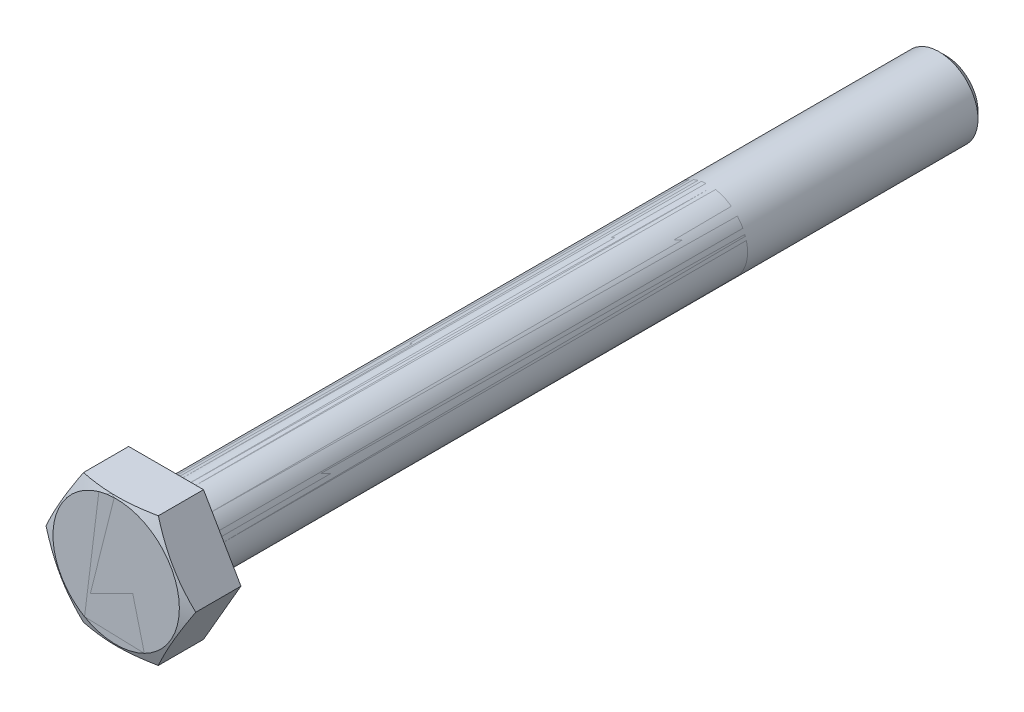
ISO-10303-21;
HEADER;
FILE_DESCRIPTION(('STEP AP214'),'2;1');
FILE_NAME('part.step','',(''),(''),'','','');
FILE_SCHEMA(('AUTOMOTIVE_DESIGN { 1 0 10303 214 1 1 1 1 }'));
ENDSEC;
DATA;
#1=APPLICATION_CONTEXT('core data for automotive mechanical design processes');
#2=APPLICATION_PROTOCOL_DEFINITION('international standard','automotive_design',2000,#1);
#3=PRODUCT_CONTEXT('',#1,'mechanical');
#4=PRODUCT('Part','Part','',(#3));
#5=PRODUCT_RELATED_PRODUCT_CATEGORY('part','',(#4));
#6=PRODUCT_DEFINITION_FORMATION('','',#4);
#7=PRODUCT_DEFINITION_CONTEXT('part definition',#1,'design');
#8=PRODUCT_DEFINITION('design','',#6,#7);
#9=PRODUCT_DEFINITION_SHAPE('','',#8);
#10=(LENGTH_UNIT() NAMED_UNIT(*) SI_UNIT(.MILLI.,.METRE.));
#11=(NAMED_UNIT(*) PLANE_ANGLE_UNIT() SI_UNIT($,.RADIAN.));
#12=(NAMED_UNIT(*) SI_UNIT($,.STERADIAN.) SOLID_ANGLE_UNIT());
#13=UNCERTAINTY_MEASURE_WITH_UNIT(LENGTH_MEASURE(1.E-05),#10,'distance_accuracy_value','');
#14=(GEOMETRIC_REPRESENTATION_CONTEXT(3) GLOBAL_UNCERTAINTY_ASSIGNED_CONTEXT((#13)) GLOBAL_UNIT_ASSIGNED_CONTEXT((#10,
#11,#12)) REPRESENTATION_CONTEXT('',''));
#15=CARTESIAN_POINT('',(0.,0.,0.));
#16=DIRECTION('',(0.,0.,1.));
#17=DIRECTION('',(1.,0.,0.));
#18=AXIS2_PLACEMENT_3D('',#15,#16,#17);
#19=CARTESIAN_POINT('',(0.,4.6,0.15));
#20=DIRECTION('',(0.,0.,1.));
#21=DIRECTION('',(1.,0.,0.));
#22=AXIS2_PLACEMENT_3D('',#19,#20,#21);
#23=PLANE('',#22);
#24=CARTESIAN_POINT('',(0.,0.,0.15));
#25=DIRECTION('',(0.,0.,1.));
#26=DIRECTION('',(1.,0.,0.));
#27=AXIS2_PLACEMENT_3D('',#24,#25,#26);
#28=CIRCLE('',#27,4.6);
#29=CARTESIAN_POINT('',(4.6,0.,0.15));
#30=VERTEX_POINT('',#29);
#31=EDGE_CURVE('P0_E225',#30,#30,#28,.T.);
#32=ORIENTED_EDGE('',*,*,#31,.T.);
#33=EDGE_LOOP('',(#32));
#34=FACE_BOUND('',#33,.T.);
#35=DIRECTION('',(-1.,0.,0.));
#36=VECTOR('',#35,1.);
#37=CARTESIAN_POINT('',(0.,-4.99999766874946,0.15));
#38=LINE('',#37,#36);
#39=CARTESIAN_POINT('',(2.88675,-4.99999766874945,0.149999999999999));
#40=VERTEX_POINT('',#39);
#41=CARTESIAN_POINT('',(-2.88675,-4.99999766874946,0.15));
#42=VERTEX_POINT('',#41);
#43=EDGE_CURVE('P0_E211',#40,#42,#38,.T.);
#44=ORIENTED_EDGE('',*,*,#43,.T.);
#45=DIRECTION('',(-0.5,0.866025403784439,0.));
#46=VECTOR('',#45,1.);
#47=CARTESIAN_POINT('',(-6.32198342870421,0.950001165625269,0.15));
#48=LINE('',#47,#46);
#49=CARTESIAN_POINT('',(-5.7735,0.,0.149999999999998));
#50=VERTEX_POINT('',#49);
#51=EDGE_CURVE('P0_E93',#42,#50,#48,.T.);
#52=ORIENTED_EDGE('',*,*,#51,.T.);
#53=DIRECTION('',(0.5,0.866025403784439,0.));
#54=VECTOR('',#53,1.);
#55=CARTESIAN_POINT('',(-2.33826657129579,5.94999883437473,0.15));
#56=LINE('',#55,#54);
#57=CARTESIAN_POINT('',(-2.88675,4.99999766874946,0.149999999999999));
#58=VERTEX_POINT('',#57);
#59=EDGE_CURVE('P0_E219',#50,#58,#56,.T.);
#60=ORIENTED_EDGE('',*,*,#59,.T.);
#61=DIRECTION('',(1.,0.,0.));
#62=VECTOR('',#61,1.);
#63=CARTESIAN_POINT('',(0.,4.99999766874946,0.15));
#64=LINE('',#63,#62);
#65=CARTESIAN_POINT('',(2.88675,4.99999766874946,0.149999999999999));
#66=VERTEX_POINT('',#65);
#67=EDGE_CURVE('P0_E216',#58,#66,#64,.T.);
#68=ORIENTED_EDGE('',*,*,#67,.T.);
#69=DIRECTION('',(0.5,-0.866025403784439,0.));
#70=VECTOR('',#69,1.);
#71=CARTESIAN_POINT('',(2.33826657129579,5.94999883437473,0.15));
#72=LINE('',#71,#70);
#73=CARTESIAN_POINT('',(5.7735,0.,0.15));
#74=VERTEX_POINT('',#73);
#75=EDGE_CURVE('P0_E214',#66,#74,#72,.T.);
#76=ORIENTED_EDGE('',*,*,#75,.T.);
#77=DIRECTION('',(-0.5,-0.866025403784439,0.));
#78=VECTOR('',#77,1.);
#79=CARTESIAN_POINT('',(6.32198342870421,0.950001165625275,0.15));
#80=LINE('',#79,#78);
#81=EDGE_CURVE('P0_E199',#74,#40,#80,.T.);
#82=ORIENTED_EDGE('',*,*,#81,.T.);
#83=EDGE_LOOP('',(#44,#52,#60,#68,#76,#82));
#84=FACE_BOUND('',#83,.T.);
#85=ADVANCED_FACE('P0_F26',(#34,#84),#23,.F.);
#86=CARTESIAN_POINT('',(0.,0.,4.));
#87=DIRECTION('',(0.,0.,1.));
#88=DIRECTION('',(1.,0.,0.));
#89=AXIS2_PLACEMENT_3D('',#86,#87,#88);
#90=CYLINDRICAL_SURFACE('',#89,3.);
#91=CARTESIAN_POINT('',(0.,0.,-0.3));
#92=DIRECTION('',(0.,0.,1.));
#93=DIRECTION('',(1.,0.,0.));
#94=AXIS2_PLACEMENT_3D('',#91,#92,#93);
#95=CIRCLE('',#94,3.);
#96=CARTESIAN_POINT('',(3.,0.,-0.3));
#97=VERTEX_POINT('',#96);
#98=EDGE_CURVE('P0_E173',#97,#97,#95,.T.);
#99=ORIENTED_EDGE('',*,*,#98,.F.);
#100=EDGE_LOOP('',(#99));
#101=FACE_BOUND('',#100,.T.);
#102=CARTESIAN_POINT('',(0.,0.,-59.45875));
#103=DIRECTION('',(0.,0.,1.));
#104=DIRECTION('',(1.,0.,0.));
#105=AXIS2_PLACEMENT_3D('',#102,#103,#104);
#106=CIRCLE('',#105,3.);
#107=CARTESIAN_POINT('',(3.,0.,-59.45875));
#108=VERTEX_POINT('',#107);
#109=EDGE_CURVE('P0_E169',#108,#108,#106,.T.);
#110=ORIENTED_EDGE('',*,*,#109,.T.);
#111=EDGE_LOOP('',(#110));
#112=FACE_BOUND('',#111,.T.);
#113=ADVANCED_FACE('P0_F139',(#101,#112),#90,.T.);
#114=CARTESIAN_POINT('',(0.,0.,-0.3));
#115=DIRECTION('',(0.,0.,1.));
#116=DIRECTION('',(1.,0.,0.));
#117=AXIS2_PLACEMENT_3D('',#114,#115,#116);
#118=TOROIDAL_SURFACE('',#117,3.3,0.3);
#119=ORIENTED_EDGE('',*,*,#98,.T.);
#120=EDGE_LOOP('',(#119));
#121=FACE_BOUND('',#120,.T.);
#122=CARTESIAN_POINT('',(0.,0.,0.));
#123=DIRECTION('',(0.,0.,1.));
#124=DIRECTION('',(1.,0.,0.));
#125=AXIS2_PLACEMENT_3D('',#122,#123,#124);
#126=CIRCLE('',#125,3.3);
#127=CARTESIAN_POINT('',(3.3,0.,0.));
#128=VERTEX_POINT('',#127);
#129=EDGE_CURVE('P0_E230',#128,#128,#126,.T.);
#130=ORIENTED_EDGE('',*,*,#129,.F.);
#131=EDGE_LOOP('',(#130));
#132=FACE_BOUND('',#131,.T.);
#133=ADVANCED_FACE('P0_F144',(#121,#132),#118,.F.);
#134=CARTESIAN_POINT('',(0.,3.3,0.));
#135=DIRECTION('',(0.,0.,1.));
#136=DIRECTION('',(1.,0.,0.));
#137=AXIS2_PLACEMENT_3D('',#134,#135,#136);
#138=PLANE('',#137);
#139=CARTESIAN_POINT('',(0.,0.,0.));
#140=DIRECTION('',(0.,0.,1.));
#141=DIRECTION('',(1.,0.,0.));
#142=AXIS2_PLACEMENT_3D('',#139,#140,#141);
#143=CIRCLE('',#142,4.45);
#144=CARTESIAN_POINT('',(4.45,0.,0.));
#145=VERTEX_POINT('',#144);
#146=EDGE_CURVE('P0_E227',#145,#145,#143,.T.);
#147=ORIENTED_EDGE('',*,*,#146,.F.);
#148=EDGE_LOOP('',(#147));
#149=FACE_BOUND('',#148,.T.);
#150=ORIENTED_EDGE('',*,*,#129,.T.);
#151=EDGE_LOOP('',(#150));
#152=FACE_BOUND('',#151,.T.);
#153=ADVANCED_FACE('P0_F152',(#149,#152),#138,.F.);
#154=CARTESIAN_POINT('',(0.,0.,0.15));
#155=DIRECTION('',(0.,0.,1.));
#156=DIRECTION('',(1.,0.,0.));
#157=AXIS2_PLACEMENT_3D('',#154,#155,#156);
#158=TOROIDAL_SURFACE('',#157,4.45,0.15);
#159=ORIENTED_EDGE('',*,*,#31,.F.);
#160=EDGE_LOOP('',(#159));
#161=FACE_BOUND('',#160,.T.);
#162=ORIENTED_EDGE('',*,*,#146,.T.);
#163=EDGE_LOOP('',(#162));
#164=FACE_BOUND('',#163,.T.);
#165=ADVANCED_FACE('P0_F126',(#161,#164),#158,.T.);
#166=CARTESIAN_POINT('',(-2.88675,-4.99999766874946,-60.));
#167=DIRECTION('',(0.866025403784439,0.5,0.));
#168=DIRECTION('',(0.5,-0.866025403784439,0.));
#169=AXIS2_PLACEMENT_3D('',#166,#167,#168);
#170=PLANE('',#169);
#171=ORIENTED_EDGE('',*,*,#51,.F.);
#172=DIRECTION('',(0.,0.,1.));
#173=VECTOR('',#172,1.);
#174=CARTESIAN_POINT('',(-2.88675,-4.99999766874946,-60.));
#175=LINE('',#174,#173);
#176=CARTESIAN_POINT('',(-2.88675,-4.99999766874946,3.63636363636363));
#177=VERTEX_POINT('',#176);
#178=EDGE_CURVE('P0_E46',#42,#177,#175,.T.);
#179=ORIENTED_EDGE('',*,*,#178,.T.);
#180=CARTESIAN_POINT('',(-5.77350011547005,2.E-07,3.6363635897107));
#181=CARTESIAN_POINT('',(-5.67264486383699,-0.174686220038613,3.67711409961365));
#182=CARTESIAN_POINT('',(-5.57145672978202,-0.349949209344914,3.71479450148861));
#183=CARTESIAN_POINT('',(-5.36841136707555,-0.701634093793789,3.78285697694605));
#184=CARTESIAN_POINT('',(-5.26655378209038,-0.878056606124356,3.81323477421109));
#185=CARTESIAN_POINT('',(-5.06231450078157,-1.23180941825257,3.86547579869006));
#186=CARTESIAN_POINT('',(-4.95993296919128,-1.40913943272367,3.88734155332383));
#187=CARTESIAN_POINT('',(-4.75478960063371,-1.76445816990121,3.92154519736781));
#188=CARTESIAN_POINT('',(-4.65202785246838,-1.94244673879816,3.93388518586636));
#189=CARTESIAN_POINT('',(-4.44806875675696,-2.29571425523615,3.94826992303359));
#190=CARTESIAN_POINT('',(-4.34687447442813,-2.47098789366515,3.95048592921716));
#191=CARTESIAN_POINT('',(-4.14454571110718,-2.8214315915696,3.94496922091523));
#192=CARTESIAN_POINT('',(-4.04341123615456,-2.99660164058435,3.93723563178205));
#193=CARTESIAN_POINT('',(-3.8415075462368,-3.34630908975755,3.91223547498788));
#194=CARTESIAN_POINT('',(-3.74073814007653,-3.52084682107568,3.89497496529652));
#195=CARTESIAN_POINT('',(-3.53968045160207,-3.86908895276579,3.85175744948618));
#196=CARTESIAN_POINT('',(-3.43939212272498,-4.04279343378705,3.82580130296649));
#197=CARTESIAN_POINT('',(-3.30156801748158,-4.28151178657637,3.78477214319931));
#198=CARTESIAN_POINT('',(-3.26378112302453,-4.34696060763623,3.77296528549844));
#199=CARTESIAN_POINT('',(-3.18829651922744,-4.47770377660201,3.74832342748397));
#200=CARTESIAN_POINT('',(-3.15059879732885,-4.54299814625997,3.73548858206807));
#201=CARTESIAN_POINT('',(-3.0751603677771,-4.6736613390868,3.70880443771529));
#202=CARTESIAN_POINT('',(-3.03741995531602,-4.739029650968,3.69495181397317));
#203=CARTESIAN_POINT('',(-2.96202181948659,-4.86962305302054,3.66632988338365));
#204=CARTESIAN_POINT('',(-2.92436410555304,-4.93484812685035,3.65156047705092));
#205=CARTESIAN_POINT('',(-2.88674988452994,-4.99999786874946,3.6363635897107));
#206=B_SPLINE_CURVE_WITH_KNOTS('',3,(#180,#181,#182,#183,#184,#185,#186,#187,#188,#189,#190,
#191,#192,#193,#194,#195,#196,#197,#198,#199,#200,#201,#202,#203,#204,#205),.UNSPECIFIED.,.F.,
.F.,(4,2,2,2,2,2,2,2,2,2,2,2,4),(0.,0.617400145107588,1.23516095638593,1.85273820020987,
2.47017931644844,3.07713614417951,3.68414633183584,4.290770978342,4.89733567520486,
5.12680289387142,5.35623560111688,5.5864543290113,5.81669808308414),.UNSPECIFIED.);
#207=CARTESIAN_POINT('',(-5.7735,0.,3.63636363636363));
#208=VERTEX_POINT('',#207);
#209=EDGE_CURVE('P0_E11',#208,#177,#206,.T.);
#210=ORIENTED_EDGE('',*,*,#209,.F.);
#211=DIRECTION('',(0.,0.,1.));
#212=VECTOR('',#211,1.);
#213=CARTESIAN_POINT('',(-5.7735,0.,-60.));
#214=LINE('',#213,#212);
#215=EDGE_CURVE('P0_E209',#50,#208,#214,.T.);
#216=ORIENTED_EDGE('',*,*,#215,.F.);
#217=EDGE_LOOP('',(#171,#179,#210,#216));
#218=FACE_BOUND('',#217,.T.);
#219=ADVANCED_FACE('P0_F89',(#218),#170,.F.);
#220=CARTESIAN_POINT('',(-5.7735,0.,-60.));
#221=DIRECTION('',(0.866025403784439,-0.5,0.));
#222=DIRECTION('',(-0.5,-0.866025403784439,0.));
#223=AXIS2_PLACEMENT_3D('',#220,#221,#222);
#224=PLANE('',#223);
#225=ORIENTED_EDGE('',*,*,#59,.F.);
#226=ORIENTED_EDGE('',*,*,#215,.T.);
#227=CARTESIAN_POINT('',(-2.88674988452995,4.99999786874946,3.6363635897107));
#228=CARTESIAN_POINT('',(-2.98760513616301,4.82531144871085,3.67711409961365));
#229=CARTESIAN_POINT('',(-3.08879327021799,4.65004845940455,3.71479450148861));
#230=CARTESIAN_POINT('',(-3.29183863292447,4.29836357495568,3.78285697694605));
#231=CARTESIAN_POINT('',(-3.39369621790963,4.12194106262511,3.81323477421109));
#232=CARTESIAN_POINT('',(-3.59793549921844,3.7681882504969,3.86547579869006));
#233=CARTESIAN_POINT('',(-3.70031703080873,3.59085823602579,3.88734155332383));
#234=CARTESIAN_POINT('',(-3.9054603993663,3.23553949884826,3.92154519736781));
#235=CARTESIAN_POINT('',(-4.00822214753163,3.05755092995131,3.93388518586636));
#236=CARTESIAN_POINT('',(-4.21218124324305,2.70428341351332,3.94826992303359));
#237=CARTESIAN_POINT('',(-4.31337552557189,2.52900977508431,3.95048592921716));
#238=CARTESIAN_POINT('',(-4.51570428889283,2.17856607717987,3.94496922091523));
#239=CARTESIAN_POINT('',(-4.61683876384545,2.00339602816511,3.93723563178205));
#240=CARTESIAN_POINT('',(-4.81874245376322,1.65368857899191,3.91223547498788));
#241=CARTESIAN_POINT('',(-4.91951185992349,1.47915084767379,3.89497496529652));
#242=CARTESIAN_POINT('',(-5.12056954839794,1.13090871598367,3.85175744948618));
#243=CARTESIAN_POINT('',(-5.220857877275,0.957204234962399,3.82580130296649));
#244=CARTESIAN_POINT('',(-5.35868198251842,0.71848588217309,3.78477214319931));
#245=CARTESIAN_POINT('',(-5.39646887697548,0.653037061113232,3.77296528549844));
#246=CARTESIAN_POINT('',(-5.47195348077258,0.522293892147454,3.74832342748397));
#247=CARTESIAN_POINT('',(-5.50965120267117,0.456999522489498,3.73548858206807));
#248=CARTESIAN_POINT('',(-5.58508963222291,0.326336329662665,3.70880443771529));
#249=CARTESIAN_POINT('',(-5.622830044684,0.260968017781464,3.69495181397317));
#250=CARTESIAN_POINT('',(-5.69822818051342,0.130374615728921,3.66632988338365));
#251=CARTESIAN_POINT('',(-5.73588589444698,0.065149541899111,3.65156047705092));
#252=CARTESIAN_POINT('',(-5.77350011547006,-1.999999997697E-07,3.6363635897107));
#253=B_SPLINE_CURVE_WITH_KNOTS('',3,(#227,#228,#229,#230,#231,#232,#233,#234,#235,#236,#237,
#238,#239,#240,#241,#242,#243,#244,#245,#246,#247,#248,#249,#250,#251,#252),.UNSPECIFIED.,.F.,
.F.,(4,2,2,2,2,2,2,2,2,2,2,2,4),(0.,0.617400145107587,1.23516095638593,1.85273820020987,
2.47017931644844,3.07713614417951,3.68414633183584,4.290770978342,4.89733567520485,
5.12680289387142,5.35623560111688,5.5864543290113,5.81669808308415),.UNSPECIFIED.);
#254=CARTESIAN_POINT('',(-2.88675,4.99999766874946,3.63636363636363));
#255=VERTEX_POINT('',#254);
#256=EDGE_CURVE('P0_E39',#255,#208,#253,.T.);
#257=ORIENTED_EDGE('',*,*,#256,.F.);
#258=DIRECTION('',(0.,0.,1.));
#259=VECTOR('',#258,1.);
#260=CARTESIAN_POINT('',(-2.88675,4.99999766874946,-60.));
#261=LINE('',#260,#259);
#262=EDGE_CURVE('P0_E204',#58,#255,#261,.T.);
#263=ORIENTED_EDGE('',*,*,#262,.F.);
#264=EDGE_LOOP('',(#225,#226,#257,#263));
#265=FACE_BOUND('',#264,.T.);
#266=ADVANCED_FACE('P0_F118',(#265),#224,.F.);
#267=CARTESIAN_POINT('',(-2.88675,4.99999766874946,-60.));
#268=DIRECTION('',(0.,-1.,0.));
#269=DIRECTION('',(-1.,0.,0.));
#270=AXIS2_PLACEMENT_3D('',#267,#268,#269);
#271=PLANE('',#270);
#272=ORIENTED_EDGE('',*,*,#67,.F.);
#273=ORIENTED_EDGE('',*,*,#262,.T.);
#274=CARTESIAN_POINT('',(-7.6419002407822,4.99999766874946,2.27932670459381));
#275=CARTESIAN_POINT('',(-7.41625282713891,4.99999766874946,2.35559400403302));
#276=CARTESIAN_POINT('',(-7.19030588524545,4.99999766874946,2.43099140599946));
#277=CARTESIAN_POINT('',(-6.73765793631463,4.99999766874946,2.57956042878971));
#278=CARTESIAN_POINT('',(-6.51095685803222,4.99999766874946,2.65273183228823));
#279=CARTESIAN_POINT('',(-6.05614421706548,4.99999766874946,2.79652022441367));
#280=CARTESIAN_POINT('',(-5.82803057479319,4.99999766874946,2.86713065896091));
#281=CARTESIAN_POINT('',(-5.37077495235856,4.99999766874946,3.00493246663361));
#282=CARTESIAN_POINT('',(-5.14163299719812,4.99999766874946,3.07212392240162));
#283=CARTESIAN_POINT('',(-4.68508481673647,4.99999766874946,3.20139051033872));
#284=CARTESIAN_POINT('',(-4.45769414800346,4.99999766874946,3.26352031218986));
#285=CARTESIAN_POINT('',(-4.00153125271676,4.99999766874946,3.38254998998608));
#286=CARTESIAN_POINT('',(-3.77275898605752,4.99999766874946,3.43944971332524));
#287=CARTESIAN_POINT('',(-3.31379746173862,4.99999766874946,3.54666385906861));
#288=CARTESIAN_POINT('',(-3.08360906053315,4.99999766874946,3.59698191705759));
#289=CARTESIAN_POINT('',(-2.6215956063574,4.99999766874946,3.68948052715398));
#290=CARTESIAN_POINT('',(-2.3897706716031,4.99999766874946,3.73166166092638));
#291=CARTESIAN_POINT('',(-1.97207589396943,4.99999766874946,3.79851184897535));
#292=CARTESIAN_POINT('',(-1.786498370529,4.99999766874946,3.82499807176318));
#293=CARTESIAN_POINT('',(-1.41446692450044,4.99999766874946,3.87081997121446));
#294=CARTESIAN_POINT('',(-1.22801307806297,4.99999766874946,3.89015625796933));
#295=CARTESIAN_POINT('',(-0.854562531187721,4.99999766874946,3.92091583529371));
#296=CARTESIAN_POINT('',(-0.667566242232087,4.99999766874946,3.9323440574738));
#297=CARTESIAN_POINT('',(-0.293246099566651,4.99999766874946,3.94680745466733));
#298=CARTESIAN_POINT('',(-0.105922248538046,4.99999766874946,3.94984269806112));
#299=CARTESIAN_POINT('',(0.269576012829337,4.99999766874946,3.94737403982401));
#300=CARTESIAN_POINT('',(0.457750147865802,4.99999766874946,3.94182870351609));
#301=CARTESIAN_POINT('',(0.833662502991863,4.99999766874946,3.92237764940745));
#302=CARTESIAN_POINT('',(1.0214007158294,4.99999766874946,3.90847179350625));
#303=CARTESIAN_POINT('',(1.39625057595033,4.99999766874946,3.87288521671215));
#304=CARTESIAN_POINT('',(1.58336174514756,4.99999766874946,3.85119952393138));
#305=CARTESIAN_POINT('',(1.95663427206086,4.99999766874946,3.80087381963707));
#306=CARTESIAN_POINT('',(2.14279563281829,4.99999766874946,3.772233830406));
#307=CARTESIAN_POINT('',(2.54590440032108,4.99999766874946,3.70348011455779));
#308=CARTESIAN_POINT('',(2.76265863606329,4.99999766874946,3.66224113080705));
#309=CARTESIAN_POINT('',(3.19475033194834,4.99999766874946,3.5728938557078));
#310=CARTESIAN_POINT('',(3.4100876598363,4.99999766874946,3.52478493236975));
#311=CARTESIAN_POINT('',(3.83953716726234,4.99999766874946,3.4229455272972));
#312=CARTESIAN_POINT('',(4.05364865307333,4.99999766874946,3.36921214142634));
#313=CARTESIAN_POINT('',(4.48066714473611,4.99999766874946,3.2572138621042));
#314=CARTESIAN_POINT('',(4.69357419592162,4.99999766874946,3.19894914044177));
#315=CARTESIAN_POINT('',(5.1189104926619,4.99999766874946,3.0785943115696));
#316=CARTESIAN_POINT('',(5.33133696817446,4.99999766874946,3.01649445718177));
#317=CARTESIAN_POINT('',(5.75529184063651,4.99999766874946,2.88929917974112));
#318=CARTESIAN_POINT('',(5.96682022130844,4.99999766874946,2.82420370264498));
#319=CARTESIAN_POINT('',(6.60013824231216,4.99999766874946,2.62531997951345));
#320=CARTESIAN_POINT('',(7.02078576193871,4.99999766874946,2.48789831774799));
#321=CARTESIAN_POINT('',(7.85707218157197,4.99999766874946,2.20744332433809));
#322=CARTESIAN_POINT('',(8.27272578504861,4.99999766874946,2.06445340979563));
#323=CARTESIAN_POINT('',(9.10246362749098,4.99999766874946,1.7739007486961));
#324=CARTESIAN_POINT('',(9.51654774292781,4.99999766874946,1.62633765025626));
#325=CARTESIAN_POINT('',(10.340757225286,4.99999766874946,1.3289092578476));
#326=CARTESIAN_POINT('',(10.750890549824,4.99999766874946,1.17906595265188));
#327=CARTESIAN_POINT('',(11.3653909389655,4.99999766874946,0.952488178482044));
#328=CARTESIAN_POINT('',(11.5700948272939,4.99999766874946,0.876664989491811));
#329=CARTESIAN_POINT('',(11.9793035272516,4.99999766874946,0.724485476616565));
#330=CARTESIAN_POINT('',(12.1838083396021,4.99999766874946,0.648129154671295));
#331=CARTESIAN_POINT('',(12.3882270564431,4.99999766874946,0.571543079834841));
#332=B_SPLINE_CURVE_WITH_KNOTS('',3,(#274,#275,#276,#277,#278,#279,#280,#281,#282,#283,#284,
#285,#286,#287,#288,#289,#290,#291,#292,#293,#294,#295,#296,#297,#298,#299,#300,#301,#302,#303,
#304,#305,#306,#307,#308,#309,#310,#311,#312,#313,#314,#315,#316,#317,#318,#319,#320,#321,#322,
#323,#324,#325,#326,#327,#328,#329,#330,#331),.UNSPECIFIED.,.F.,.F.,(4,2,2,2,2,2,2,2,2,2,2,2,2,
2,2,2,2,2,2,2,2,2,2,2,2,2,2,2,4),(0.,0.714569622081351,1.42920878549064,2.14556357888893,
2.86190104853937,3.56902940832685,4.27617839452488,4.98293510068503,5.6896412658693,
6.2518960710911,6.81410288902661,7.37595878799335,7.93781010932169,8.50238302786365,
9.06696527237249,9.63190897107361,10.1968508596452,10.8586384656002,11.5204869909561,
12.1826789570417,12.8448458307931,13.5087710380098,14.1727082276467,15.5001923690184,
16.8188447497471,18.137598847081,19.4475358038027,20.1024211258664,20.757304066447),.UNSPECIFIED.);
#333=CARTESIAN_POINT('',(2.88675,4.99999766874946,3.63636363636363));
#334=VERTEX_POINT('',#333);
#335=EDGE_CURVE('P0_E100',#334,#255,#332,.F.);
#336=ORIENTED_EDGE('',*,*,#335,.F.);
#337=DIRECTION('',(0.,0.,1.));
#338=VECTOR('',#337,1.);
#339=CARTESIAN_POINT('',(2.88675,4.99999766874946,-60.));
#340=LINE('',#339,#338);
#341=EDGE_CURVE('P0_E201',#66,#334,#340,.T.);
#342=ORIENTED_EDGE('',*,*,#341,.F.);
#343=EDGE_LOOP('',(#272,#273,#336,#342));
#344=FACE_BOUND('',#343,.T.);
#345=ADVANCED_FACE('P0_F121',(#344),#271,.F.);
#346=CARTESIAN_POINT('',(2.88675,4.99999766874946,-60.));
#347=DIRECTION('',(-0.866025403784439,-0.5,0.));
#348=DIRECTION('',(-0.5,0.866025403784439,0.));
#349=AXIS2_PLACEMENT_3D('',#346,#347,#348);
#350=PLANE('',#349);
#351=ORIENTED_EDGE('',*,*,#75,.F.);
#352=ORIENTED_EDGE('',*,*,#341,.T.);
#353=CARTESIAN_POINT('',(5.77350011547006,-2.00000000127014E-07,3.6363635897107));
#354=CARTESIAN_POINT('',(5.67264486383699,0.174686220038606,3.67711409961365));
#355=CARTESIAN_POINT('',(5.57145672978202,0.349949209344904,3.71479450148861));
#356=CARTESIAN_POINT('',(5.36841136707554,0.701634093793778,3.78285697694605));
#357=CARTESIAN_POINT('',(5.26655378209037,0.878056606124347,3.81323477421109));
#358=CARTESIAN_POINT('',(5.06231450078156,1.23180941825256,3.86547579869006));
#359=CARTESIAN_POINT('',(4.95993296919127,1.40913943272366,3.88734155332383));
#360=CARTESIAN_POINT('',(4.7547896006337,1.7644581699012,3.92154519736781));
#361=CARTESIAN_POINT('',(4.65202785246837,1.94244673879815,3.93388518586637));
#362=CARTESIAN_POINT('',(4.44806875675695,2.29571425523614,3.94826992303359));
#363=CARTESIAN_POINT('',(4.34687447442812,2.47098789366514,3.95048592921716));
#364=CARTESIAN_POINT('',(4.14454571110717,2.82143159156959,3.94496922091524));
#365=CARTESIAN_POINT('',(4.04341123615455,2.99660164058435,3.93723563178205));
#366=CARTESIAN_POINT('',(3.84150754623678,3.34630908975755,3.91223547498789));
#367=CARTESIAN_POINT('',(3.74073814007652,3.52084682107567,3.89497496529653));
#368=CARTESIAN_POINT('',(3.53968045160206,3.86908895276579,3.85175744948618));
#369=CARTESIAN_POINT('',(3.43939212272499,4.04279343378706,3.82580130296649));
#370=CARTESIAN_POINT('',(3.30156801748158,4.28151178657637,3.78477214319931));
#371=CARTESIAN_POINT('',(3.26378112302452,4.34696060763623,3.77296528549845));
#372=CARTESIAN_POINT('',(3.18829651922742,4.47770377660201,3.74832342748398));
#373=CARTESIAN_POINT('',(3.15059879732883,4.54299814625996,3.73548858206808));
#374=CARTESIAN_POINT('',(3.07516036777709,4.6736613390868,3.70880443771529));
#375=CARTESIAN_POINT('',(3.037419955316,4.739029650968,3.69495181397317));
#376=CARTESIAN_POINT('',(2.96202181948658,4.86962305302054,3.66632988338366));
#377=CARTESIAN_POINT('',(2.92436410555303,4.93484812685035,3.65156047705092));
#378=CARTESIAN_POINT('',(2.88674988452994,4.99999786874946,3.6363635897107));
#379=B_SPLINE_CURVE_WITH_KNOTS('',3,(#353,#354,#355,#356,#357,#358,#359,#360,#361,#362,#363,
#364,#365,#366,#367,#368,#369,#370,#371,#372,#373,#374,#375,#376,#377,#378),.UNSPECIFIED.,.F.,
.F.,(4,2,2,2,2,2,2,2,2,2,2,2,4),(0.,0.61740014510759,1.23516095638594,1.85273820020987,
2.47017931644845,3.07713614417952,3.68414633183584,4.29077097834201,4.89733567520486,
5.12680289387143,5.35623560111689,5.58645432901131,5.81669808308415),.UNSPECIFIED.);
#380=CARTESIAN_POINT('',(5.7735,0.,3.63636363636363));
#381=VERTEX_POINT('',#380);
#382=EDGE_CURVE('P0_E104',#381,#334,#379,.T.);
#383=ORIENTED_EDGE('',*,*,#382,.F.);
#384=DIRECTION('',(0.,0.,1.));
#385=VECTOR('',#384,1.);
#386=CARTESIAN_POINT('',(5.7735,0.,-60.));
#387=LINE('',#386,#385);
#388=EDGE_CURVE('P0_E198',#74,#381,#387,.T.);
#389=ORIENTED_EDGE('',*,*,#388,.F.);
#390=EDGE_LOOP('',(#351,#352,#383,#389));
#391=FACE_BOUND('',#390,.T.);
#392=ADVANCED_FACE('P0_F187',(#391),#350,.F.);
#393=CARTESIAN_POINT('',(5.7735,0.,-60.));
#394=DIRECTION('',(-0.866025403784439,0.5,0.));
#395=DIRECTION('',(0.5,0.866025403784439,0.));
#396=AXIS2_PLACEMENT_3D('',#393,#394,#395);
#397=PLANE('',#396);
#398=ORIENTED_EDGE('',*,*,#81,.F.);
#399=ORIENTED_EDGE('',*,*,#388,.T.);
#400=CARTESIAN_POINT('',(2.88674988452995,-4.99999786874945,3.6363635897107));
#401=CARTESIAN_POINT('',(2.98760513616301,-4.82531144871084,3.67711409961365));
#402=CARTESIAN_POINT('',(3.08879327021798,-4.65004845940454,3.71479450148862));
#403=CARTESIAN_POINT('',(3.29183863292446,-4.29836357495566,3.78285697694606));
#404=CARTESIAN_POINT('',(3.39369621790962,-4.12194106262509,3.8132347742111));
#405=CARTESIAN_POINT('',(3.59793549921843,-3.76818825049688,3.86547579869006));
#406=CARTESIAN_POINT('',(3.70031703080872,-3.59085823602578,3.88734155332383));
#407=CARTESIAN_POINT('',(3.90546039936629,-3.23553949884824,3.92154519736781));
#408=CARTESIAN_POINT('',(4.00822214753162,-3.05755092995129,3.93388518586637));
#409=CARTESIAN_POINT('',(4.21218124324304,-2.70428341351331,3.94826992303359));
#410=CARTESIAN_POINT('',(4.31337552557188,-2.5290097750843,3.95048592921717));
#411=CARTESIAN_POINT('',(4.51570428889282,-2.17856607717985,3.94496922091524));
#412=CARTESIAN_POINT('',(4.61683876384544,-2.0033960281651,3.93723563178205));
#413=CARTESIAN_POINT('',(4.81874245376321,-1.6536885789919,3.91223547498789));
#414=CARTESIAN_POINT('',(4.91951185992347,-1.47915084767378,3.89497496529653));
#415=CARTESIAN_POINT('',(5.12056954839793,-1.13090871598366,3.85175744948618));
#416=CARTESIAN_POINT('',(5.22085787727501,-0.9572042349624,3.82580130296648));
#417=CARTESIAN_POINT('',(5.35868198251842,-0.718485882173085,3.78477214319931));
#418=CARTESIAN_POINT('',(5.39646887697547,-0.653037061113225,3.77296528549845));
#419=CARTESIAN_POINT('',(5.47195348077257,-0.522293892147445,3.74832342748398));
#420=CARTESIAN_POINT('',(5.50965120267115,-0.45699952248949,3.73548858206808));
#421=CARTESIAN_POINT('',(5.5850896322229,-0.326336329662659,3.7088044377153));
#422=CARTESIAN_POINT('',(5.62283004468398,-0.260968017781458,3.69495181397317));
#423=CARTESIAN_POINT('',(5.69822818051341,-0.130374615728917,3.66632988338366));
#424=CARTESIAN_POINT('',(5.73588589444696,-0.0651495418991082,3.65156047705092));
#425=CARTESIAN_POINT('',(5.77350011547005,1.99999999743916E-07,3.6363635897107));
#426=B_SPLINE_CURVE_WITH_KNOTS('',3,(#400,#401,#402,#403,#404,#405,#406,#407,#408,#409,#410,
#411,#412,#413,#414,#415,#416,#417,#418,#419,#420,#421,#422,#423,#424,#425),.UNSPECIFIED.,.F.,
.F.,(4,2,2,2,2,2,2,2,2,2,2,2,4),(0.,0.61740014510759,1.23516095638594,1.85273820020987,
2.47017931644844,3.07713614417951,3.68414633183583,4.290770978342,4.89733567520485,
5.12680289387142,5.35623560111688,5.58645432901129,5.81669808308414),.UNSPECIFIED.);
#427=CARTESIAN_POINT('',(2.88675,-4.99999766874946,3.63636363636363));
#428=VERTEX_POINT('',#427);
#429=EDGE_CURVE('P0_E85',#428,#381,#426,.T.);
#430=ORIENTED_EDGE('',*,*,#429,.F.);
#431=DIRECTION('',(0.,0.,1.));
#432=VECTOR('',#431,1.);
#433=CARTESIAN_POINT('',(2.88675,-4.99999766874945,-60.));
#434=LINE('',#433,#432);
#435=EDGE_CURVE('P0_E51',#40,#428,#434,.T.);
#436=ORIENTED_EDGE('',*,*,#435,.F.);
#437=EDGE_LOOP('',(#398,#399,#430,#436));
#438=FACE_BOUND('',#437,.T.);
#439=ADVANCED_FACE('P0_F135',(#438),#397,.F.);
#440=CARTESIAN_POINT('',(2.88675,-4.99999766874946,-60.));
#441=DIRECTION('',(0.,1.,0.));
#442=DIRECTION('',(1.,0.,0.));
#443=AXIS2_PLACEMENT_3D('',#440,#441,#442);
#444=PLANE('',#443);
#445=ORIENTED_EDGE('',*,*,#43,.F.);
#446=ORIENTED_EDGE('',*,*,#435,.T.);
#447=CARTESIAN_POINT('',(-7.64190024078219,-4.99999766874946,2.27932670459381));
#448=CARTESIAN_POINT('',(-7.4162528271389,-4.99999766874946,2.35559400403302));
#449=CARTESIAN_POINT('',(-7.19030588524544,-4.99999766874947,2.43099140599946));
#450=CARTESIAN_POINT('',(-6.73765793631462,-4.99999766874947,2.57956042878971));
#451=CARTESIAN_POINT('',(-6.51095685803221,-4.99999766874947,2.65273183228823));
#452=CARTESIAN_POINT('',(-6.05614421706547,-4.99999766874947,2.79652022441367));
#453=CARTESIAN_POINT('',(-5.82803057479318,-4.99999766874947,2.86713065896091));
#454=CARTESIAN_POINT('',(-5.37077495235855,-4.99999766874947,3.00493246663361));
#455=CARTESIAN_POINT('',(-5.14163299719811,-4.99999766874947,3.07212392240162));
#456=CARTESIAN_POINT('',(-4.68508481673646,-4.99999766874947,3.20139051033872));
#457=CARTESIAN_POINT('',(-4.45769414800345,-4.99999766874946,3.26352031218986));
#458=CARTESIAN_POINT('',(-4.00153125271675,-4.99999766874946,3.38254998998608));
#459=CARTESIAN_POINT('',(-3.77275898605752,-4.99999766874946,3.43944971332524));
#460=CARTESIAN_POINT('',(-3.31379746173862,-4.99999766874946,3.54666385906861));
#461=CARTESIAN_POINT('',(-3.08360906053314,-4.99999766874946,3.59698191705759));
#462=CARTESIAN_POINT('',(-2.62159560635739,-4.99999766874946,3.68948052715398));
#463=CARTESIAN_POINT('',(-2.38977067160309,-4.99999766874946,3.73166166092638));
#464=CARTESIAN_POINT('',(-1.97207589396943,-4.99999766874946,3.79851184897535));
#465=CARTESIAN_POINT('',(-1.78649837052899,-4.99999766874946,3.82499807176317));
#466=CARTESIAN_POINT('',(-1.41446692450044,-4.99999766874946,3.87081997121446));
#467=CARTESIAN_POINT('',(-1.22801307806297,-4.99999766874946,3.89015625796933));
#468=CARTESIAN_POINT('',(-0.854562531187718,-4.99999766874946,3.9209158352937));
#469=CARTESIAN_POINT('',(-0.667566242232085,-4.99999766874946,3.9323440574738));
#470=CARTESIAN_POINT('',(-0.293246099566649,-4.99999766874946,3.94680745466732));
#471=CARTESIAN_POINT('',(-0.105922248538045,-4.99999766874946,3.94984269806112));
#472=CARTESIAN_POINT('',(0.269576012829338,-4.99999766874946,3.94737403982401));
#473=CARTESIAN_POINT('',(0.457750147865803,-4.99999766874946,3.94182870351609));
#474=CARTESIAN_POINT('',(0.833662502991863,-4.99999766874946,3.92237764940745));
#475=CARTESIAN_POINT('',(1.0214007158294,-4.99999766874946,3.90847179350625));
#476=CARTESIAN_POINT('',(1.39625057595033,-4.99999766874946,3.87288521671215));
#477=CARTESIAN_POINT('',(1.58336174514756,-4.99999766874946,3.85119952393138));
#478=CARTESIAN_POINT('',(1.95663427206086,-4.99999766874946,3.80087381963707));
#479=CARTESIAN_POINT('',(2.14279563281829,-4.99999766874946,3.772233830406));
#480=CARTESIAN_POINT('',(2.54590440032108,-4.99999766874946,3.70348011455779));
#481=CARTESIAN_POINT('',(2.76265863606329,-4.99999766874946,3.66224113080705));
#482=CARTESIAN_POINT('',(3.19475033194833,-4.99999766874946,3.5728938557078));
#483=CARTESIAN_POINT('',(3.4100876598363,-4.99999766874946,3.52478493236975));
#484=CARTESIAN_POINT('',(3.83953716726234,-4.99999766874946,3.42294552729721));
#485=CARTESIAN_POINT('',(4.05364865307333,-4.99999766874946,3.36921214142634));
#486=CARTESIAN_POINT('',(4.48066714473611,-4.99999766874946,3.2572138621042));
#487=CARTESIAN_POINT('',(4.69357419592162,-4.99999766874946,3.19894914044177));
#488=CARTESIAN_POINT('',(5.1189104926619,-4.99999766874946,3.0785943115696));
#489=CARTESIAN_POINT('',(5.33133696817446,-4.99999766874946,3.01649445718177));
#490=CARTESIAN_POINT('',(5.75529184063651,-4.99999766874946,2.88929917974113));
#491=CARTESIAN_POINT('',(5.96682022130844,-4.99999766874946,2.82420370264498));
#492=CARTESIAN_POINT('',(6.60013824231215,-4.99999766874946,2.62531997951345));
#493=CARTESIAN_POINT('',(7.02078576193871,-4.99999766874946,2.48789831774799));
#494=CARTESIAN_POINT('',(7.85707218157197,-4.99999766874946,2.20744332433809));
#495=CARTESIAN_POINT('',(8.27272578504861,-4.99999766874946,2.06445340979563));
#496=CARTESIAN_POINT('',(9.10246362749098,-4.99999766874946,1.7739007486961));
#497=CARTESIAN_POINT('',(9.51654774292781,-4.99999766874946,1.62633765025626));
#498=CARTESIAN_POINT('',(10.340757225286,-4.99999766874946,1.3289092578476));
#499=CARTESIAN_POINT('',(10.750890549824,-4.99999766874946,1.17906595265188));
#500=CARTESIAN_POINT('',(11.3653909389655,-4.99999766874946,0.952488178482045));
#501=CARTESIAN_POINT('',(11.5700948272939,-4.99999766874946,0.876664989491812));
#502=CARTESIAN_POINT('',(11.9793035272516,-4.99999766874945,0.724485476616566));
#503=CARTESIAN_POINT('',(12.1838083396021,-4.99999766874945,0.648129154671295));
#504=CARTESIAN_POINT('',(12.3882270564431,-4.99999766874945,0.57154307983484));
#505=B_SPLINE_CURVE_WITH_KNOTS('',3,(#447,#448,#449,#450,#451,#452,#453,#454,#455,#456,#457,
#458,#459,#460,#461,#462,#463,#464,#465,#466,#467,#468,#469,#470,#471,#472,#473,#474,#475,#476,
#477,#478,#479,#480,#481,#482,#483,#484,#485,#486,#487,#488,#489,#490,#491,#492,#493,#494,#495,
#496,#497,#498,#499,#500,#501,#502,#503,#504),.UNSPECIFIED.,.F.,.F.,(4,2,2,2,2,2,2,2,2,2,2,2,2,
2,2,2,2,2,2,2,2,2,2,2,2,2,2,2,4),(0.,0.714569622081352,1.42920878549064,2.14556357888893,
2.86190104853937,3.56902940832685,4.27617839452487,4.98293510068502,5.68964126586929,
6.2518960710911,6.8141028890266,7.37595878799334,7.93781010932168,8.50238302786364,
9.06696527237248,9.6319089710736,10.1968508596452,10.8586384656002,11.5204869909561,
12.1826789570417,12.8448458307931,13.5087710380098,14.1727082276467,15.5001923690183,
16.8188447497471,18.137598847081,19.4475358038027,20.1024211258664,20.757304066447),.UNSPECIFIED.);
#506=EDGE_CURVE('P0_E81',#177,#428,#505,.T.);
#507=ORIENTED_EDGE('',*,*,#506,.F.);
#508=ORIENTED_EDGE('',*,*,#178,.F.);
#509=EDGE_LOOP('',(#445,#446,#507,#508));
#510=FACE_BOUND('',#509,.T.);
#511=ADVANCED_FACE('P0_F82',(#510),#444,.F.);
#512=CARTESIAN_POINT('',(0.,4.87346841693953,4.));
#513=DIRECTION('',(0.,0.,-1.));
#514=DIRECTION('',(-1.,0.,0.));
#515=AXIS2_PLACEMENT_3D('',#512,#513,#514);
#516=PLANE('',#515);
#517=CARTESIAN_POINT('',(0.,0.,4.));
#518=DIRECTION('',(0.,0.,1.));
#519=DIRECTION('',(1.,0.,0.));
#520=AXIS2_PLACEMENT_3D('',#517,#518,#519);
#521=CIRCLE('',#520,4.87346841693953);
#522=CARTESIAN_POINT('',(4.87346841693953,0.,4.));
#523=VERTEX_POINT('',#522);
#524=EDGE_CURVE('P0_E223',#523,#523,#521,.T.);
#525=ORIENTED_EDGE('',*,*,#524,.T.);
#526=EDGE_LOOP('',(#525));
#527=FACE_BOUND('',#526,.T.);
#528=ADVANCED_FACE('P0_F127',(#527),#516,.F.);
#529=CARTESIAN_POINT('',(0.,0.,3.63636363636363));
#530=DIRECTION('',(0.,0.,-1.));
#531=DIRECTION('',(-1.,0.,0.));
#532=AXIS2_PLACEMENT_3D('',#529,#530,#531);
#533=CONICAL_SURFACE('',#532,5.7735,1.18682389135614);
#534=ORIENTED_EDGE('',*,*,#524,.F.);
#535=EDGE_LOOP('',(#534));
#536=FACE_BOUND('',#535,.T.);
#537=ORIENTED_EDGE('',*,*,#256,.T.);
#538=ORIENTED_EDGE('',*,*,#209,.T.);
#539=ORIENTED_EDGE('',*,*,#506,.T.);
#540=ORIENTED_EDGE('',*,*,#429,.T.);
#541=ORIENTED_EDGE('',*,*,#382,.T.);
#542=ORIENTED_EDGE('',*,*,#335,.T.);
#543=EDGE_LOOP('',(#537,#538,#539,#540,#541,#542));
#544=FACE_BOUND('',#543,.T.);
#545=ADVANCED_FACE('P0_F97',(#536,#544),#533,.T.);
#546=CARTESIAN_POINT('',(0.,0.,-60.));
#547=DIRECTION('',(0.,0.,1.));
#548=DIRECTION('',(1.,0.,0.));
#549=AXIS2_PLACEMENT_3D('',#546,#547,#548);
#550=PLANE('',#549);
#551=CARTESIAN_POINT('',(0.,0.,-60.));
#552=DIRECTION('',(0.,0.,1.));
#553=DIRECTION('',(1.,0.,0.));
#554=AXIS2_PLACEMENT_3D('',#551,#552,#553);
#555=CIRCLE('',#554,2.45875);
#556=CARTESIAN_POINT('',(2.45875,0.,-60.));
#557=VERTEX_POINT('',#556);
#558=EDGE_CURVE('P0_E86',#557,#557,#555,.T.);
#559=ORIENTED_EDGE('',*,*,#558,.F.);
#560=EDGE_LOOP('',(#559));
#561=FACE_BOUND('',#560,.T.);
#562=ADVANCED_FACE('P0_F28',(#561),#550,.F.);
#563=CARTESIAN_POINT('',(0.,0.,-60.));
#564=DIRECTION('',(0.,0.,1.));
#565=DIRECTION('',(1.,0.,0.));
#566=AXIS2_PLACEMENT_3D('',#563,#564,#565);
#567=CONICAL_SURFACE('',#566,2.45875,0.78539816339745);
#568=ORIENTED_EDGE('',*,*,#109,.F.);
#569=EDGE_LOOP('',(#568));
#570=FACE_BOUND('',#569,.T.);
#571=ORIENTED_EDGE('',*,*,#558,.T.);
#572=EDGE_LOOP('',(#571));
#573=FACE_BOUND('',#572,.T.);
#574=ADVANCED_FACE('P0_F159',(#570,#573),#567,.T.);
#575=CLOSED_SHELL('',(#85,#113,#133,#153,#165,#219,#266,#345,#392,#439,#511,#528,#545,#562,#574));
#576=MANIFOLD_SOLID_BREP('P0_B2',#575);
#577=CARTESIAN_POINT('',(0.,4.6,0.15));
#578=DIRECTION('',(0.,0.,1.));
#579=DIRECTION('',(1.,0.,0.));
#580=AXIS2_PLACEMENT_3D('',#577,#578,#579);
#581=PLANE('',#580);
#582=CARTESIAN_POINT('',(0.,0.,0.15));
#583=DIRECTION('',(0.,0.,1.));
#584=DIRECTION('',(1.,0.,0.));
#585=AXIS2_PLACEMENT_3D('',#582,#583,#584);
#586=CIRCLE('',#585,4.6);
#587=CARTESIAN_POINT('',(4.6,0.,0.15));
#588=VERTEX_POINT('',#587);
#589=EDGE_CURVE('P1_E228',#588,#588,#586,.T.);
#590=ORIENTED_EDGE('',*,*,#589,.T.);
#591=EDGE_LOOP('',(#590));
#592=FACE_BOUND('',#591,.T.);
#593=DIRECTION('',(-1.,0.,0.));
#594=VECTOR('',#593,1.);
#595=CARTESIAN_POINT('',(0.,-4.99999766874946,0.15));
#596=LINE('',#595,#594);
#597=CARTESIAN_POINT('',(2.88675,-4.99999766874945,0.149999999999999));
#598=VERTEX_POINT('',#597);
#599=CARTESIAN_POINT('',(-2.88675,-4.99999766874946,0.15));
#600=VERTEX_POINT('',#599);
#601=EDGE_CURVE('P1_E214',#598,#600,#596,.T.);
#602=ORIENTED_EDGE('',*,*,#601,.T.);
#603=DIRECTION('',(-0.5,0.866025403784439,0.));
#604=VECTOR('',#603,1.);
#605=CARTESIAN_POINT('',(-6.32198342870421,0.950001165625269,0.15));
#606=LINE('',#605,#604);
#607=CARTESIAN_POINT('',(-5.7735,0.,0.149999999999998));
#608=VERTEX_POINT('',#607);
#609=EDGE_CURVE('P1_E83',#600,#608,#606,.T.);
#610=ORIENTED_EDGE('',*,*,#609,.T.);
#611=DIRECTION('',(0.5,0.866025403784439,0.));
#612=VECTOR('',#611,1.);
#613=CARTESIAN_POINT('',(-2.33826657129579,5.94999883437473,0.15));
#614=LINE('',#613,#612);
#615=CARTESIAN_POINT('',(-2.88675,4.99999766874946,0.149999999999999));
#616=VERTEX_POINT('',#615);
#617=EDGE_CURVE('P1_E222',#608,#616,#614,.T.);
#618=ORIENTED_EDGE('',*,*,#617,.T.);
#619=DIRECTION('',(1.,0.,0.));
#620=VECTOR('',#619,1.);
#621=CARTESIAN_POINT('',(0.,4.99999766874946,0.15));
#622=LINE('',#621,#620);
#623=CARTESIAN_POINT('',(2.88675,4.99999766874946,0.149999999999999));
#624=VERTEX_POINT('',#623);
#625=EDGE_CURVE('P1_E219',#616,#624,#622,.T.);
#626=ORIENTED_EDGE('',*,*,#625,.T.);
#627=DIRECTION('',(0.5,-0.866025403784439,0.));
#628=VECTOR('',#627,1.);
#629=CARTESIAN_POINT('',(2.33826657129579,5.94999883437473,0.15));
#630=LINE('',#629,#628);
#631=CARTESIAN_POINT('',(5.7735,0.,0.15));
#632=VERTEX_POINT('',#631);
#633=EDGE_CURVE('P1_E217',#624,#632,#630,.T.);
#634=ORIENTED_EDGE('',*,*,#633,.T.);
#635=DIRECTION('',(-0.5,-0.866025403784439,0.));
#636=VECTOR('',#635,1.);
#637=CARTESIAN_POINT('',(6.32198342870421,0.950001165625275,0.15));
#638=LINE('',#637,#636);
#639=EDGE_CURVE('P1_E202',#632,#598,#638,.T.);
#640=ORIENTED_EDGE('',*,*,#639,.T.);
#641=EDGE_LOOP('',(#602,#610,#618,#626,#634,#640));
#642=FACE_BOUND('',#641,.T.);
#643=ADVANCED_FACE('P1_F16',(#592,#642),#581,.F.);
#644=CARTESIAN_POINT('',(0.,0.,-60.));
#645=DIRECTION('',(0.,0.,1.));
#646=DIRECTION('',(1.,0.,0.));
#647=AXIS2_PLACEMENT_3D('',#644,#645,#646);
#648=PLANE('',#647);
#649=CARTESIAN_POINT('',(0.,0.,-60.));
#650=DIRECTION('',(0.,0.,1.));
#651=DIRECTION('',(1.,0.,0.));
#652=AXIS2_PLACEMENT_3D('',#649,#650,#651);
#653=CIRCLE('',#652,2.45875);
#654=CARTESIAN_POINT('',(2.45875,0.,-60.));
#655=VERTEX_POINT('',#654);
#656=EDGE_CURVE('P1_E76',#655,#655,#653,.T.);
#657=ORIENTED_EDGE('',*,*,#656,.F.);
#658=EDGE_LOOP('',(#657));
#659=FACE_BOUND('',#658,.T.);
#660=ADVANCED_FACE('P1_F18',(#659),#648,.F.);
#661=CARTESIAN_POINT('',(0.,0.,-60.));
#662=DIRECTION('',(0.,0.,1.));
#663=DIRECTION('',(1.,0.,0.));
#664=AXIS2_PLACEMENT_3D('',#661,#662,#663);
#665=CONICAL_SURFACE('',#664,2.45875,0.78539816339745);
#666=CARTESIAN_POINT('',(0.,0.,-59.45875));
#667=DIRECTION('',(0.,0.,1.));
#668=DIRECTION('',(1.,0.,0.));
#669=AXIS2_PLACEMENT_3D('',#666,#667,#668);
#670=CIRCLE('',#669,3.);
#671=CARTESIAN_POINT('',(3.,0.,-59.45875));
#672=VERTEX_POINT('',#671);
#673=EDGE_CURVE('P1_E172',#672,#672,#670,.T.);
#674=ORIENTED_EDGE('',*,*,#673,.F.);
#675=EDGE_LOOP('',(#674));
#676=FACE_BOUND('',#675,.T.);
#677=ORIENTED_EDGE('',*,*,#656,.T.);
#678=EDGE_LOOP('',(#677));
#679=FACE_BOUND('',#678,.T.);
#680=ADVANCED_FACE('P1_F134',(#676,#679),#665,.T.);
#681=CARTESIAN_POINT('',(0.,0.,4.));
#682=DIRECTION('',(0.,0.,1.));
#683=DIRECTION('',(1.,0.,0.));
#684=AXIS2_PLACEMENT_3D('',#681,#682,#683);
#685=CYLINDRICAL_SURFACE('',#684,3.);
#686=CARTESIAN_POINT('',(0.,0.,-42.));
#687=DIRECTION('',(0.,0.,1.));
#688=DIRECTION('',(1.,0.,0.));
#689=AXIS2_PLACEMENT_3D('',#686,#687,#688);
#690=CIRCLE('',#689,3.);
#691=CARTESIAN_POINT('',(3.,0.,-42.));
#692=VERTEX_POINT('',#691);
#693=EDGE_CURVE('P1_E176',#692,#692,#690,.T.);
#694=ORIENTED_EDGE('',*,*,#693,.F.);
#695=EDGE_LOOP('',(#694));
#696=FACE_BOUND('',#695,.T.);
#697=ORIENTED_EDGE('',*,*,#673,.T.);
#698=EDGE_LOOP('',(#697));
#699=FACE_BOUND('',#698,.T.);
#700=ADVANCED_FACE('P1_F161',(#696,#699),#685,.T.);
#701=CARTESIAN_POINT('',(0.,3.,-42.));
#702=DIRECTION('',(0.,0.,-1.));
#703=DIRECTION('',(-1.,0.,0.));
#704=AXIS2_PLACEMENT_3D('',#701,#702,#703);
#705=PLANE('',#704);
#706=CARTESIAN_POINT('',(0.,0.,-42.));
#707=DIRECTION('',(0.,0.,1.));
#708=DIRECTION('',(1.,0.,0.));
#709=AXIS2_PLACEMENT_3D('',#706,#707,#708);
#710=CIRCLE('',#709,2.45875);
#711=CARTESIAN_POINT('',(2.45875,0.,-42.));
#712=VERTEX_POINT('',#711);
#713=EDGE_CURVE('P1_E242',#712,#712,#710,.T.);
#714=ORIENTED_EDGE('',*,*,#713,.F.);
#715=EDGE_LOOP('',(#714));
#716=FACE_BOUND('',#715,.T.);
#717=ORIENTED_EDGE('',*,*,#693,.T.);
#718=EDGE_LOOP('',(#717));
#719=FACE_BOUND('',#718,.T.);
#720=ADVANCED_FACE('P1_F157',(#716,#719),#705,.F.);
#721=CARTESIAN_POINT('',(0.,0.,-42.));
#722=DIRECTION('',(0.,0.,1.));
#723=DIRECTION('',(1.,0.,0.));
#724=AXIS2_PLACEMENT_3D('',#721,#722,#723);
#725=CONICAL_SURFACE('',#724,2.45875,1.0471975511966);
#726=CARTESIAN_POINT('',(0.,0.,-41.6875091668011));
#727=DIRECTION('',(0.,0.,1.));
#728=DIRECTION('',(1.,0.,0.));
#729=AXIS2_PLACEMENT_3D('',#726,#727,#728);
#730=CIRCLE('',#729,3.);
#731=CARTESIAN_POINT('',(3.,0.,-41.6875091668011));
#732=VERTEX_POINT('',#731);
#733=EDGE_CURVE('P1_E239',#732,#732,#730,.T.);
#734=ORIENTED_EDGE('',*,*,#733,.F.);
#735=EDGE_LOOP('',(#734));
#736=FACE_BOUND('',#735,.T.);
#737=ORIENTED_EDGE('',*,*,#713,.T.);
#738=EDGE_LOOP('',(#737));
#739=FACE_BOUND('',#738,.T.);
#740=ADVANCED_FACE('P1_F153',(#736,#739),#725,.T.);
#741=CARTESIAN_POINT('',(0.,0.,4.));
#742=DIRECTION('',(0.,0.,1.));
#743=DIRECTION('',(1.,0.,0.));
#744=AXIS2_PLACEMENT_3D('',#741,#742,#743);
#745=CYLINDRICAL_SURFACE('',#744,3.);
#746=CARTESIAN_POINT('',(0.,0.,-0.3));
#747=DIRECTION('',(0.,0.,1.));
#748=DIRECTION('',(1.,0.,0.));
#749=AXIS2_PLACEMENT_3D('',#746,#747,#748);
#750=CIRCLE('',#749,3.);
#751=CARTESIAN_POINT('',(3.,0.,-0.3));
#752=VERTEX_POINT('',#751);
#753=EDGE_CURVE('P1_E236',#752,#752,#750,.T.);
#754=ORIENTED_EDGE('',*,*,#753,.F.);
#755=EDGE_LOOP('',(#754));
#756=FACE_BOUND('',#755,.T.);
#757=ORIENTED_EDGE('',*,*,#733,.T.);
#758=EDGE_LOOP('',(#757));
#759=FACE_BOUND('',#758,.T.);
#760=ADVANCED_FACE('P1_F149',(#756,#759),#745,.T.);
#761=CARTESIAN_POINT('',(0.,0.,-0.3));
#762=DIRECTION('',(0.,0.,1.));
#763=DIRECTION('',(1.,0.,0.));
#764=AXIS2_PLACEMENT_3D('',#761,#762,#763);
#765=TOROIDAL_SURFACE('',#764,3.3,0.3);
#766=ORIENTED_EDGE('',*,*,#753,.T.);
#767=EDGE_LOOP('',(#766));
#768=FACE_BOUND('',#767,.T.);
#769=CARTESIAN_POINT('',(0.,0.,0.));
#770=DIRECTION('',(0.,0.,1.));
#771=DIRECTION('',(1.,0.,0.));
#772=AXIS2_PLACEMENT_3D('',#769,#770,#771);
#773=CIRCLE('',#772,3.3);
#774=CARTESIAN_POINT('',(3.3,0.,0.));
#775=VERTEX_POINT('',#774);
#776=EDGE_CURVE('P1_E233',#775,#775,#773,.T.);
#777=ORIENTED_EDGE('',*,*,#776,.F.);
#778=EDGE_LOOP('',(#777));
#779=FACE_BOUND('',#778,.T.);
#780=ADVANCED_FACE('P1_F145',(#768,#779),#765,.F.);
#781=CARTESIAN_POINT('',(0.,3.3,0.));
#782=DIRECTION('',(0.,0.,1.));
#783=DIRECTION('',(1.,0.,0.));
#784=AXIS2_PLACEMENT_3D('',#781,#782,#783);
#785=PLANE('',#784);
#786=CARTESIAN_POINT('',(0.,0.,0.));
#787=DIRECTION('',(0.,0.,1.));
#788=DIRECTION('',(1.,0.,0.));
#789=AXIS2_PLACEMENT_3D('',#786,#787,#788);
#790=CIRCLE('',#789,4.45);
#791=CARTESIAN_POINT('',(4.45,0.,0.));
#792=VERTEX_POINT('',#791);
#793=EDGE_CURVE('P1_E230',#792,#792,#790,.T.);
#794=ORIENTED_EDGE('',*,*,#793,.F.);
#795=EDGE_LOOP('',(#794));
#796=FACE_BOUND('',#795,.T.);
#797=ORIENTED_EDGE('',*,*,#776,.T.);
#798=EDGE_LOOP('',(#797));
#799=FACE_BOUND('',#798,.T.);
#800=ADVANCED_FACE('P1_F141',(#796,#799),#785,.F.);
#801=CARTESIAN_POINT('',(0.,0.,0.15));
#802=DIRECTION('',(0.,0.,1.));
#803=DIRECTION('',(1.,0.,0.));
#804=AXIS2_PLACEMENT_3D('',#801,#802,#803);
#805=TOROIDAL_SURFACE('',#804,4.45,0.15);
#806=ORIENTED_EDGE('',*,*,#589,.F.);
#807=EDGE_LOOP('',(#806));
#808=FACE_BOUND('',#807,.T.);
#809=ORIENTED_EDGE('',*,*,#793,.T.);
#810=EDGE_LOOP('',(#809));
#811=FACE_BOUND('',#810,.T.);
#812=ADVANCED_FACE('P1_F116',(#808,#811),#805,.T.);
#813=CARTESIAN_POINT('',(-2.88675,-4.99999766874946,-60.));
#814=DIRECTION('',(0.866025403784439,0.5,0.));
#815=DIRECTION('',(0.5,-0.866025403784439,0.));
#816=AXIS2_PLACEMENT_3D('',#813,#814,#815);
#817=PLANE('',#816);
#818=ORIENTED_EDGE('',*,*,#609,.F.);
#819=DIRECTION('',(0.,0.,1.));
#820=VECTOR('',#819,1.);
#821=CARTESIAN_POINT('',(-2.88675,-4.99999766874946,-60.));
#822=LINE('',#821,#820);
#823=CARTESIAN_POINT('',(-2.88675,-4.99999766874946,3.63636363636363));
#824=VERTEX_POINT('',#823);
#825=EDGE_CURVE('P1_E36',#600,#824,#822,.T.);
#826=ORIENTED_EDGE('',*,*,#825,.T.);
#827=CARTESIAN_POINT('',(-5.77350011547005,2.E-07,3.6363635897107));
#828=CARTESIAN_POINT('',(-5.67264486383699,-0.174686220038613,3.67711409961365));
#829=CARTESIAN_POINT('',(-5.57145672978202,-0.349949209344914,3.71479450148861));
#830=CARTESIAN_POINT('',(-5.36841136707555,-0.701634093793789,3.78285697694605));
#831=CARTESIAN_POINT('',(-5.26655378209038,-0.878056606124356,3.81323477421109));
#832=CARTESIAN_POINT('',(-5.06231450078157,-1.23180941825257,3.86547579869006));
#833=CARTESIAN_POINT('',(-4.95993296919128,-1.40913943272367,3.88734155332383));
#834=CARTESIAN_POINT('',(-4.75478960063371,-1.76445816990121,3.92154519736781));
#835=CARTESIAN_POINT('',(-4.65202785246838,-1.94244673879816,3.93388518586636));
#836=CARTESIAN_POINT('',(-4.44806875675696,-2.29571425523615,3.94826992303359));
#837=CARTESIAN_POINT('',(-4.34687447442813,-2.47098789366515,3.95048592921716));
#838=CARTESIAN_POINT('',(-4.14454571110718,-2.8214315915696,3.94496922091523));
#839=CARTESIAN_POINT('',(-4.04341123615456,-2.99660164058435,3.93723563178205));
#840=CARTESIAN_POINT('',(-3.8415075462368,-3.34630908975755,3.91223547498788));
#841=CARTESIAN_POINT('',(-3.74073814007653,-3.52084682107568,3.89497496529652));
#842=CARTESIAN_POINT('',(-3.53968045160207,-3.86908895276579,3.85175744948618));
#843=CARTESIAN_POINT('',(-3.43939212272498,-4.04279343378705,3.82580130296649));
#844=CARTESIAN_POINT('',(-3.30156801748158,-4.28151178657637,3.78477214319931));
#845=CARTESIAN_POINT('',(-3.26378112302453,-4.34696060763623,3.77296528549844));
#846=CARTESIAN_POINT('',(-3.18829651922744,-4.47770377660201,3.74832342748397));
#847=CARTESIAN_POINT('',(-3.15059879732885,-4.54299814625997,3.73548858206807));
#848=CARTESIAN_POINT('',(-3.0751603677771,-4.6736613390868,3.70880443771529));
#849=CARTESIAN_POINT('',(-3.03741995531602,-4.739029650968,3.69495181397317));
#850=CARTESIAN_POINT('',(-2.96202181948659,-4.86962305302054,3.66632988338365));
#851=CARTESIAN_POINT('',(-2.92436410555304,-4.93484812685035,3.65156047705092));
#852=CARTESIAN_POINT('',(-2.88674988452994,-4.99999786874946,3.6363635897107));
#853=B_SPLINE_CURVE_WITH_KNOTS('',3,(#827,#828,#829,#830,#831,#832,#833,#834,#835,#836,#837,
#838,#839,#840,#841,#842,#843,#844,#845,#846,#847,#848,#849,#850,#851,#852),.UNSPECIFIED.,.F.,
.F.,(4,2,2,2,2,2,2,2,2,2,2,2,4),(0.,0.617400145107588,1.23516095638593,1.85273820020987,
2.47017931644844,3.07713614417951,3.68414633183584,4.290770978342,4.89733567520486,
5.12680289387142,5.35623560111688,5.5864543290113,5.81669808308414),.UNSPECIFIED.);
#854=CARTESIAN_POINT('',(-5.7735,0.,3.63636363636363));
#855=VERTEX_POINT('',#854);
#856=EDGE_CURVE('P1_E11',#855,#824,#853,.T.);
#857=ORIENTED_EDGE('',*,*,#856,.F.);
#858=DIRECTION('',(0.,0.,1.));
#859=VECTOR('',#858,1.);
#860=CARTESIAN_POINT('',(-5.7735,0.,-60.));
#861=LINE('',#860,#859);
#862=EDGE_CURVE('P1_E212',#608,#855,#861,.T.);
#863=ORIENTED_EDGE('',*,*,#862,.F.);
#864=EDGE_LOOP('',(#818,#826,#857,#863));
#865=FACE_BOUND('',#864,.T.);
#866=ADVANCED_FACE('P1_F79',(#865),#817,.F.);
#867=CARTESIAN_POINT('',(-5.7735,0.,-60.));
#868=DIRECTION('',(0.866025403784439,-0.5,0.));
#869=DIRECTION('',(-0.5,-0.866025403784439,0.));
#870=AXIS2_PLACEMENT_3D('',#867,#868,#869);
#871=PLANE('',#870);
#872=ORIENTED_EDGE('',*,*,#617,.F.);
#873=ORIENTED_EDGE('',*,*,#862,.T.);
#874=CARTESIAN_POINT('',(-2.88674988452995,4.99999786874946,3.6363635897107));
#875=CARTESIAN_POINT('',(-2.98760513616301,4.82531144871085,3.67711409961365));
#876=CARTESIAN_POINT('',(-3.08879327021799,4.65004845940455,3.71479450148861));
#877=CARTESIAN_POINT('',(-3.29183863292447,4.29836357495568,3.78285697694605));
#878=CARTESIAN_POINT('',(-3.39369621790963,4.12194106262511,3.81323477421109));
#879=CARTESIAN_POINT('',(-3.59793549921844,3.7681882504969,3.86547579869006));
#880=CARTESIAN_POINT('',(-3.70031703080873,3.59085823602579,3.88734155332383));
#881=CARTESIAN_POINT('',(-3.9054603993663,3.23553949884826,3.92154519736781));
#882=CARTESIAN_POINT('',(-4.00822214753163,3.05755092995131,3.93388518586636));
#883=CARTESIAN_POINT('',(-4.21218124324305,2.70428341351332,3.94826992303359));
#884=CARTESIAN_POINT('',(-4.31337552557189,2.52900977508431,3.95048592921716));
#885=CARTESIAN_POINT('',(-4.51570428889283,2.17856607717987,3.94496922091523));
#886=CARTESIAN_POINT('',(-4.61683876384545,2.00339602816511,3.93723563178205));
#887=CARTESIAN_POINT('',(-4.81874245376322,1.65368857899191,3.91223547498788));
#888=CARTESIAN_POINT('',(-4.91951185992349,1.47915084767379,3.89497496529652));
#889=CARTESIAN_POINT('',(-5.12056954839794,1.13090871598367,3.85175744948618));
#890=CARTESIAN_POINT('',(-5.220857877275,0.957204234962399,3.82580130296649));
#891=CARTESIAN_POINT('',(-5.35868198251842,0.71848588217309,3.78477214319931));
#892=CARTESIAN_POINT('',(-5.39646887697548,0.653037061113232,3.77296528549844));
#893=CARTESIAN_POINT('',(-5.47195348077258,0.522293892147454,3.74832342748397));
#894=CARTESIAN_POINT('',(-5.50965120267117,0.456999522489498,3.73548858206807));
#895=CARTESIAN_POINT('',(-5.58508963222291,0.326336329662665,3.70880443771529));
#896=CARTESIAN_POINT('',(-5.622830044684,0.260968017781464,3.69495181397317));
#897=CARTESIAN_POINT('',(-5.69822818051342,0.130374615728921,3.66632988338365));
#898=CARTESIAN_POINT('',(-5.73588589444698,0.065149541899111,3.65156047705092));
#899=CARTESIAN_POINT('',(-5.77350011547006,-1.999999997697E-07,3.6363635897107));
#900=B_SPLINE_CURVE_WITH_KNOTS('',3,(#874,#875,#876,#877,#878,#879,#880,#881,#882,#883,#884,
#885,#886,#887,#888,#889,#890,#891,#892,#893,#894,#895,#896,#897,#898,#899),.UNSPECIFIED.,.F.,
.F.,(4,2,2,2,2,2,2,2,2,2,2,2,4),(0.,0.617400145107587,1.23516095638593,1.85273820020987,
2.47017931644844,3.07713614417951,3.68414633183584,4.290770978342,4.89733567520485,
5.12680289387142,5.35623560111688,5.5864543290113,5.81669808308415),.UNSPECIFIED.);
#901=CARTESIAN_POINT('',(-2.88675,4.99999766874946,3.63636363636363));
#902=VERTEX_POINT('',#901);
#903=EDGE_CURVE('P1_E29',#902,#855,#900,.T.);
#904=ORIENTED_EDGE('',*,*,#903,.F.);
#905=DIRECTION('',(0.,0.,1.));
#906=VECTOR('',#905,1.);
#907=CARTESIAN_POINT('',(-2.88675,4.99999766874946,-60.));
#908=LINE('',#907,#906);
#909=EDGE_CURVE('P1_E207',#616,#902,#908,.T.);
#910=ORIENTED_EDGE('',*,*,#909,.F.);
#911=EDGE_LOOP('',(#872,#873,#904,#910));
#912=FACE_BOUND('',#911,.T.);
#913=ADVANCED_FACE('P1_F108',(#912),#871,.F.);
#914=CARTESIAN_POINT('',(-2.88675,4.99999766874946,-60.));
#915=DIRECTION('',(0.,-1.,0.));
#916=DIRECTION('',(-1.,0.,0.));
#917=AXIS2_PLACEMENT_3D('',#914,#915,#916);
#918=PLANE('',#917);
#919=ORIENTED_EDGE('',*,*,#625,.F.);
#920=ORIENTED_EDGE('',*,*,#909,.T.);
#921=CARTESIAN_POINT('',(-7.6419002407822,4.99999766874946,2.27932670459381));
#922=CARTESIAN_POINT('',(-7.41625282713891,4.99999766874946,2.35559400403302));
#923=CARTESIAN_POINT('',(-7.19030588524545,4.99999766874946,2.43099140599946));
#924=CARTESIAN_POINT('',(-6.73765793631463,4.99999766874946,2.57956042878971));
#925=CARTESIAN_POINT('',(-6.51095685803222,4.99999766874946,2.65273183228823));
#926=CARTESIAN_POINT('',(-6.05614421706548,4.99999766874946,2.79652022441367));
#927=CARTESIAN_POINT('',(-5.82803057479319,4.99999766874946,2.86713065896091));
#928=CARTESIAN_POINT('',(-5.37077495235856,4.99999766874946,3.00493246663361));
#929=CARTESIAN_POINT('',(-5.14163299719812,4.99999766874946,3.07212392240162));
#930=CARTESIAN_POINT('',(-4.68508481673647,4.99999766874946,3.20139051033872));
#931=CARTESIAN_POINT('',(-4.45769414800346,4.99999766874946,3.26352031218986));
#932=CARTESIAN_POINT('',(-4.00153125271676,4.99999766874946,3.38254998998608));
#933=CARTESIAN_POINT('',(-3.77275898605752,4.99999766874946,3.43944971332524));
#934=CARTESIAN_POINT('',(-3.31379746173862,4.99999766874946,3.54666385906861));
#935=CARTESIAN_POINT('',(-3.08360906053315,4.99999766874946,3.59698191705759));
#936=CARTESIAN_POINT('',(-2.6215956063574,4.99999766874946,3.68948052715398));
#937=CARTESIAN_POINT('',(-2.3897706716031,4.99999766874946,3.73166166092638));
#938=CARTESIAN_POINT('',(-1.97207589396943,4.99999766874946,3.79851184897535));
#939=CARTESIAN_POINT('',(-1.786498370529,4.99999766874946,3.82499807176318));
#940=CARTESIAN_POINT('',(-1.41446692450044,4.99999766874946,3.87081997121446));
#941=CARTESIAN_POINT('',(-1.22801307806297,4.99999766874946,3.89015625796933));
#942=CARTESIAN_POINT('',(-0.854562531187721,4.99999766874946,3.92091583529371));
#943=CARTESIAN_POINT('',(-0.667566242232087,4.99999766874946,3.9323440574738));
#944=CARTESIAN_POINT('',(-0.293246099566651,4.99999766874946,3.94680745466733));
#945=CARTESIAN_POINT('',(-0.105922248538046,4.99999766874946,3.94984269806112));
#946=CARTESIAN_POINT('',(0.269576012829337,4.99999766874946,3.94737403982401));
#947=CARTESIAN_POINT('',(0.457750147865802,4.99999766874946,3.94182870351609));
#948=CARTESIAN_POINT('',(0.833662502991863,4.99999766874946,3.92237764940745));
#949=CARTESIAN_POINT('',(1.0214007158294,4.99999766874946,3.90847179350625));
#950=CARTESIAN_POINT('',(1.39625057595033,4.99999766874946,3.87288521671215));
#951=CARTESIAN_POINT('',(1.58336174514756,4.99999766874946,3.85119952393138));
#952=CARTESIAN_POINT('',(1.95663427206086,4.99999766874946,3.80087381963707));
#953=CARTESIAN_POINT('',(2.14279563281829,4.99999766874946,3.772233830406));
#954=CARTESIAN_POINT('',(2.54590440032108,4.99999766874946,3.70348011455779));
#955=CARTESIAN_POINT('',(2.76265863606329,4.99999766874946,3.66224113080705));
#956=CARTESIAN_POINT('',(3.19475033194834,4.99999766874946,3.5728938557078));
#957=CARTESIAN_POINT('',(3.4100876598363,4.99999766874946,3.52478493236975));
#958=CARTESIAN_POINT('',(3.83953716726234,4.99999766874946,3.4229455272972));
#959=CARTESIAN_POINT('',(4.05364865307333,4.99999766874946,3.36921214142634));
#960=CARTESIAN_POINT('',(4.48066714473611,4.99999766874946,3.2572138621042));
#961=CARTESIAN_POINT('',(4.69357419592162,4.99999766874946,3.19894914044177));
#962=CARTESIAN_POINT('',(5.1189104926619,4.99999766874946,3.0785943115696));
#963=CARTESIAN_POINT('',(5.33133696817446,4.99999766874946,3.01649445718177));
#964=CARTESIAN_POINT('',(5.75529184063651,4.99999766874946,2.88929917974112));
#965=CARTESIAN_POINT('',(5.96682022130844,4.99999766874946,2.82420370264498));
#966=CARTESIAN_POINT('',(6.60013824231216,4.99999766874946,2.62531997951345));
#967=CARTESIAN_POINT('',(7.02078576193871,4.99999766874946,2.48789831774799));
#968=CARTESIAN_POINT('',(7.85707218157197,4.99999766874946,2.20744332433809));
#969=CARTESIAN_POINT('',(8.27272578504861,4.99999766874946,2.06445340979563));
#970=CARTESIAN_POINT('',(9.10246362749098,4.99999766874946,1.7739007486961));
#971=CARTESIAN_POINT('',(9.51654774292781,4.99999766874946,1.62633765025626));
#972=CARTESIAN_POINT('',(10.340757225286,4.99999766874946,1.3289092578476));
#973=CARTESIAN_POINT('',(10.750890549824,4.99999766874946,1.17906595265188));
#974=CARTESIAN_POINT('',(11.3653909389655,4.99999766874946,0.952488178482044));
#975=CARTESIAN_POINT('',(11.5700948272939,4.99999766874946,0.876664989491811));
#976=CARTESIAN_POINT('',(11.9793035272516,4.99999766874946,0.724485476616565));
#977=CARTESIAN_POINT('',(12.1838083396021,4.99999766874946,0.648129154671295));
#978=CARTESIAN_POINT('',(12.3882270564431,4.99999766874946,0.571543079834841));
#979=B_SPLINE_CURVE_WITH_KNOTS('',3,(#921,#922,#923,#924,#925,#926,#927,#928,#929,#930,#931,
#932,#933,#934,#935,#936,#937,#938,#939,#940,#941,#942,#943,#944,#945,#946,#947,#948,#949,#950,
#951,#952,#953,#954,#955,#956,#957,#958,#959,#960,#961,#962,#963,#964,#965,#966,#967,#968,#969,
#970,#971,#972,#973,#974,#975,#976,#977,#978),.UNSPECIFIED.,.F.,.F.,(4,2,2,2,2,2,2,2,2,2,2,2,2,
2,2,2,2,2,2,2,2,2,2,2,2,2,2,2,4),(0.,0.714569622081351,1.42920878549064,2.14556357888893,
2.86190104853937,3.56902940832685,4.27617839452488,4.98293510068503,5.6896412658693,
6.2518960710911,6.81410288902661,7.37595878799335,7.93781010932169,8.50238302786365,
9.06696527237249,9.63190897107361,10.1968508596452,10.8586384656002,11.5204869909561,
12.1826789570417,12.8448458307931,13.5087710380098,14.1727082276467,15.5001923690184,
16.8188447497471,18.137598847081,19.4475358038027,20.1024211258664,20.757304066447),.UNSPECIFIED.);
#980=CARTESIAN_POINT('',(2.88675,4.99999766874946,3.63636363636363));
#981=VERTEX_POINT('',#980);
#982=EDGE_CURVE('P1_E90',#981,#902,#979,.F.);
#983=ORIENTED_EDGE('',*,*,#982,.F.);
#984=DIRECTION('',(0.,0.,1.));
#985=VECTOR('',#984,1.);
#986=CARTESIAN_POINT('',(2.88675,4.99999766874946,-60.));
#987=LINE('',#986,#985);
#988=EDGE_CURVE('P1_E204',#624,#981,#987,.T.);
#989=ORIENTED_EDGE('',*,*,#988,.F.);
#990=EDGE_LOOP('',(#919,#920,#983,#989));
#991=FACE_BOUND('',#990,.T.);
#992=ADVANCED_FACE('P1_F111',(#991),#918,.F.);
#993=CARTESIAN_POINT('',(2.88675,4.99999766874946,-60.));
#994=DIRECTION('',(-0.866025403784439,-0.5,0.));
#995=DIRECTION('',(-0.5,0.866025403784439,0.));
#996=AXIS2_PLACEMENT_3D('',#993,#994,#995);
#997=PLANE('',#996);
#998=ORIENTED_EDGE('',*,*,#633,.F.);
#999=ORIENTED_EDGE('',*,*,#988,.T.);
#1000=CARTESIAN_POINT('',(5.77350011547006,-2.00000000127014E-07,3.6363635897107));
#1001=CARTESIAN_POINT('',(5.67264486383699,0.174686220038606,3.67711409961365));
#1002=CARTESIAN_POINT('',(5.57145672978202,0.349949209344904,3.71479450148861));
#1003=CARTESIAN_POINT('',(5.36841136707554,0.701634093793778,3.78285697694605));
#1004=CARTESIAN_POINT('',(5.26655378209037,0.878056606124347,3.81323477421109));
#1005=CARTESIAN_POINT('',(5.06231450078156,1.23180941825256,3.86547579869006));
#1006=CARTESIAN_POINT('',(4.95993296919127,1.40913943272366,3.88734155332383));
#1007=CARTESIAN_POINT('',(4.7547896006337,1.7644581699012,3.92154519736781));
#1008=CARTESIAN_POINT('',(4.65202785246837,1.94244673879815,3.93388518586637));
#1009=CARTESIAN_POINT('',(4.44806875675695,2.29571425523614,3.94826992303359));
#1010=CARTESIAN_POINT('',(4.34687447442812,2.47098789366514,3.95048592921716));
#1011=CARTESIAN_POINT('',(4.14454571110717,2.82143159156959,3.94496922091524));
#1012=CARTESIAN_POINT('',(4.04341123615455,2.99660164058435,3.93723563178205));
#1013=CARTESIAN_POINT('',(3.84150754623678,3.34630908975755,3.91223547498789));
#1014=CARTESIAN_POINT('',(3.74073814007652,3.52084682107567,3.89497496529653));
#1015=CARTESIAN_POINT('',(3.53968045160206,3.86908895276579,3.85175744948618));
#1016=CARTESIAN_POINT('',(3.43939212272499,4.04279343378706,3.82580130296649));
#1017=CARTESIAN_POINT('',(3.30156801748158,4.28151178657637,3.78477214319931));
#1018=CARTESIAN_POINT('',(3.26378112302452,4.34696060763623,3.77296528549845));
#1019=CARTESIAN_POINT('',(3.18829651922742,4.47770377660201,3.74832342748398));
#1020=CARTESIAN_POINT('',(3.15059879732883,4.54299814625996,3.73548858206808));
#1021=CARTESIAN_POINT('',(3.07516036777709,4.6736613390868,3.70880443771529));
#1022=CARTESIAN_POINT('',(3.037419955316,4.739029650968,3.69495181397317));
#1023=CARTESIAN_POINT('',(2.96202181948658,4.86962305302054,3.66632988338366));
#1024=CARTESIAN_POINT('',(2.92436410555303,4.93484812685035,3.65156047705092));
#1025=CARTESIAN_POINT('',(2.88674988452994,4.99999786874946,3.6363635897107));
#1026=B_SPLINE_CURVE_WITH_KNOTS('',3,(#1000,#1001,#1002,#1003,#1004,#1005,#1006,#1007,#1008,
#1009,#1010,#1011,#1012,#1013,#1014,#1015,#1016,#1017,#1018,#1019,#1020,#1021,#1022,#1023,#1024,
#1025),.UNSPECIFIED.,.F.,.F.,(4,2,2,2,2,2,2,2,2,2,2,2,4),(0.,0.61740014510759,1.23516095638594,
1.85273820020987,2.47017931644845,3.07713614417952,3.68414633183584,4.29077097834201,
4.89733567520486,5.12680289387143,5.35623560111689,5.58645432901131,5.81669808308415),.UNSPECIFIED.);
#1027=CARTESIAN_POINT('',(5.7735,0.,3.63636363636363));
#1028=VERTEX_POINT('',#1027);
#1029=EDGE_CURVE('P1_E94',#1028,#981,#1026,.T.);
#1030=ORIENTED_EDGE('',*,*,#1029,.F.);
#1031=DIRECTION('',(0.,0.,1.));
#1032=VECTOR('',#1031,1.);
#1033=CARTESIAN_POINT('',(5.7735,0.,-60.));
#1034=LINE('',#1033,#1032);
#1035=EDGE_CURVE('P1_E201',#632,#1028,#1034,.T.);
#1036=ORIENTED_EDGE('',*,*,#1035,.F.);
#1037=EDGE_LOOP('',(#998,#999,#1030,#1036));
#1038=FACE_BOUND('',#1037,.T.);
#1039=ADVANCED_FACE('P1_F190',(#1038),#997,.F.);
#1040=CARTESIAN_POINT('',(5.7735,0.,-60.));
#1041=DIRECTION('',(-0.866025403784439,0.5,0.));
#1042=DIRECTION('',(0.5,0.866025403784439,0.));
#1043=AXIS2_PLACEMENT_3D('',#1040,#1041,#1042);
#1044=PLANE('',#1043);
#1045=ORIENTED_EDGE('',*,*,#639,.F.);
#1046=ORIENTED_EDGE('',*,*,#1035,.T.);
#1047=CARTESIAN_POINT('',(2.88674988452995,-4.99999786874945,3.6363635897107));
#1048=CARTESIAN_POINT('',(2.98760513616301,-4.82531144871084,3.67711409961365));
#1049=CARTESIAN_POINT('',(3.08879327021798,-4.65004845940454,3.71479450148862));
#1050=CARTESIAN_POINT('',(3.29183863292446,-4.29836357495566,3.78285697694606));
#1051=CARTESIAN_POINT('',(3.39369621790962,-4.12194106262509,3.8132347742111));
#1052=CARTESIAN_POINT('',(3.59793549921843,-3.76818825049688,3.86547579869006));
#1053=CARTESIAN_POINT('',(3.70031703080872,-3.59085823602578,3.88734155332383));
#1054=CARTESIAN_POINT('',(3.90546039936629,-3.23553949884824,3.92154519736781));
#1055=CARTESIAN_POINT('',(4.00822214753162,-3.05755092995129,3.93388518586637));
#1056=CARTESIAN_POINT('',(4.21218124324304,-2.70428341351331,3.94826992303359));
#1057=CARTESIAN_POINT('',(4.31337552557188,-2.5290097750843,3.95048592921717));
#1058=CARTESIAN_POINT('',(4.51570428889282,-2.17856607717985,3.94496922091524));
#1059=CARTESIAN_POINT('',(4.61683876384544,-2.0033960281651,3.93723563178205));
#1060=CARTESIAN_POINT('',(4.81874245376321,-1.6536885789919,3.91223547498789));
#1061=CARTESIAN_POINT('',(4.91951185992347,-1.47915084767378,3.89497496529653));
#1062=CARTESIAN_POINT('',(5.12056954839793,-1.13090871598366,3.85175744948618));
#1063=CARTESIAN_POINT('',(5.22085787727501,-0.9572042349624,3.82580130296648));
#1064=CARTESIAN_POINT('',(5.35868198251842,-0.718485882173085,3.78477214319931));
#1065=CARTESIAN_POINT('',(5.39646887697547,-0.653037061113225,3.77296528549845));
#1066=CARTESIAN_POINT('',(5.47195348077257,-0.522293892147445,3.74832342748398));
#1067=CARTESIAN_POINT('',(5.50965120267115,-0.45699952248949,3.73548858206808));
#1068=CARTESIAN_POINT('',(5.5850896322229,-0.326336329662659,3.7088044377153));
#1069=CARTESIAN_POINT('',(5.62283004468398,-0.260968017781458,3.69495181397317));
#1070=CARTESIAN_POINT('',(5.69822818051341,-0.130374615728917,3.66632988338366));
#1071=CARTESIAN_POINT('',(5.73588589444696,-0.0651495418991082,3.65156047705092));
#1072=CARTESIAN_POINT('',(5.77350011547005,1.99999999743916E-07,3.6363635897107));
#1073=B_SPLINE_CURVE_WITH_KNOTS('',3,(#1047,#1048,#1049,#1050,#1051,#1052,#1053,#1054,#1055,
#1056,#1057,#1058,#1059,#1060,#1061,#1062,#1063,#1064,#1065,#1066,#1067,#1068,#1069,#1070,#1071,
#1072),.UNSPECIFIED.,.F.,.F.,(4,2,2,2,2,2,2,2,2,2,2,2,4),(0.,0.61740014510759,1.23516095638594,
1.85273820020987,2.47017931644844,3.07713614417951,3.68414633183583,4.290770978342,
4.89733567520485,5.12680289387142,5.35623560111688,5.58645432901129,5.81669808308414),.UNSPECIFIED.);
#1074=CARTESIAN_POINT('',(2.88675,-4.99999766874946,3.63636363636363));
#1075=VERTEX_POINT('',#1074);
#1076=EDGE_CURVE('P1_E75',#1075,#1028,#1073,.T.);
#1077=ORIENTED_EDGE('',*,*,#1076,.F.);
#1078=DIRECTION('',(0.,0.,1.));
#1079=VECTOR('',#1078,1.);
#1080=CARTESIAN_POINT('',(2.88675,-4.99999766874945,-60.));
#1081=LINE('',#1080,#1079);
#1082=EDGE_CURVE('P1_E41',#598,#1075,#1081,.T.);
#1083=ORIENTED_EDGE('',*,*,#1082,.F.);
#1084=EDGE_LOOP('',(#1045,#1046,#1077,#1083));
#1085=FACE_BOUND('',#1084,.T.);
#1086=ADVANCED_FACE('P1_F126',(#1085),#1044,.F.);
#1087=CARTESIAN_POINT('',(2.88675,-4.99999766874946,-60.));
#1088=DIRECTION('',(0.,1.,0.));
#1089=DIRECTION('',(1.,0.,0.));
#1090=AXIS2_PLACEMENT_3D('',#1087,#1088,#1089);
#1091=PLANE('',#1090);
#1092=ORIENTED_EDGE('',*,*,#601,.F.);
#1093=ORIENTED_EDGE('',*,*,#1082,.T.);
#1094=CARTESIAN_POINT('',(-7.64190024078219,-4.99999766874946,2.27932670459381));
#1095=CARTESIAN_POINT('',(-7.4162528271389,-4.99999766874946,2.35559400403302));
#1096=CARTESIAN_POINT('',(-7.19030588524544,-4.99999766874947,2.43099140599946));
#1097=CARTESIAN_POINT('',(-6.73765793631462,-4.99999766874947,2.57956042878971));
#1098=CARTESIAN_POINT('',(-6.51095685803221,-4.99999766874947,2.65273183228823));
#1099=CARTESIAN_POINT('',(-6.05614421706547,-4.99999766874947,2.79652022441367));
#1100=CARTESIAN_POINT('',(-5.82803057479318,-4.99999766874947,2.86713065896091));
#1101=CARTESIAN_POINT('',(-5.37077495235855,-4.99999766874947,3.00493246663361));
#1102=CARTESIAN_POINT('',(-5.14163299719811,-4.99999766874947,3.07212392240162));
#1103=CARTESIAN_POINT('',(-4.68508481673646,-4.99999766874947,3.20139051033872));
#1104=CARTESIAN_POINT('',(-4.45769414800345,-4.99999766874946,3.26352031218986));
#1105=CARTESIAN_POINT('',(-4.00153125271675,-4.99999766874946,3.38254998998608));
#1106=CARTESIAN_POINT('',(-3.77275898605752,-4.99999766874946,3.43944971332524));
#1107=CARTESIAN_POINT('',(-3.31379746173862,-4.99999766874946,3.54666385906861));
#1108=CARTESIAN_POINT('',(-3.08360906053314,-4.99999766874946,3.59698191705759));
#1109=CARTESIAN_POINT('',(-2.62159560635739,-4.99999766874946,3.68948052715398));
#1110=CARTESIAN_POINT('',(-2.38977067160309,-4.99999766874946,3.73166166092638));
#1111=CARTESIAN_POINT('',(-1.97207589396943,-4.99999766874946,3.79851184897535));
#1112=CARTESIAN_POINT('',(-1.78649837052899,-4.99999766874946,3.82499807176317));
#1113=CARTESIAN_POINT('',(-1.41446692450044,-4.99999766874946,3.87081997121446));
#1114=CARTESIAN_POINT('',(-1.22801307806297,-4.99999766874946,3.89015625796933));
#1115=CARTESIAN_POINT('',(-0.854562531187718,-4.99999766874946,3.9209158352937));
#1116=CARTESIAN_POINT('',(-0.667566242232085,-4.99999766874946,3.9323440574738));
#1117=CARTESIAN_POINT('',(-0.293246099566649,-4.99999766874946,3.94680745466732));
#1118=CARTESIAN_POINT('',(-0.105922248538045,-4.99999766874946,3.94984269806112));
#1119=CARTESIAN_POINT('',(0.269576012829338,-4.99999766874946,3.94737403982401));
#1120=CARTESIAN_POINT('',(0.457750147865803,-4.99999766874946,3.94182870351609));
#1121=CARTESIAN_POINT('',(0.833662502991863,-4.99999766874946,3.92237764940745));
#1122=CARTESIAN_POINT('',(1.0214007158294,-4.99999766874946,3.90847179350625));
#1123=CARTESIAN_POINT('',(1.39625057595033,-4.99999766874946,3.87288521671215));
#1124=CARTESIAN_POINT('',(1.58336174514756,-4.99999766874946,3.85119952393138));
#1125=CARTESIAN_POINT('',(1.95663427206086,-4.99999766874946,3.80087381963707));
#1126=CARTESIAN_POINT('',(2.14279563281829,-4.99999766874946,3.772233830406));
#1127=CARTESIAN_POINT('',(2.54590440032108,-4.99999766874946,3.70348011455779));
#1128=CARTESIAN_POINT('',(2.76265863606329,-4.99999766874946,3.66224113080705));
#1129=CARTESIAN_POINT('',(3.19475033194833,-4.99999766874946,3.5728938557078));
#1130=CARTESIAN_POINT('',(3.4100876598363,-4.99999766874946,3.52478493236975));
#1131=CARTESIAN_POINT('',(3.83953716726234,-4.99999766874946,3.42294552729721));
#1132=CARTESIAN_POINT('',(4.05364865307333,-4.99999766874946,3.36921214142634));
#1133=CARTESIAN_POINT('',(4.48066714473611,-4.99999766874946,3.2572138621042));
#1134=CARTESIAN_POINT('',(4.69357419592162,-4.99999766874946,3.19894914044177));
#1135=CARTESIAN_POINT('',(5.1189104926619,-4.99999766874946,3.0785943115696));
#1136=CARTESIAN_POINT('',(5.33133696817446,-4.99999766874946,3.01649445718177));
#1137=CARTESIAN_POINT('',(5.75529184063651,-4.99999766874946,2.88929917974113));
#1138=CARTESIAN_POINT('',(5.96682022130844,-4.99999766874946,2.82420370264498));
#1139=CARTESIAN_POINT('',(6.60013824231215,-4.99999766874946,2.62531997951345));
#1140=CARTESIAN_POINT('',(7.02078576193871,-4.99999766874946,2.48789831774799));
#1141=CARTESIAN_POINT('',(7.85707218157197,-4.99999766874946,2.20744332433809));
#1142=CARTESIAN_POINT('',(8.27272578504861,-4.99999766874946,2.06445340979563));
#1143=CARTESIAN_POINT('',(9.10246362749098,-4.99999766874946,1.7739007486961));
#1144=CARTESIAN_POINT('',(9.51654774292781,-4.99999766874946,1.62633765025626));
#1145=CARTESIAN_POINT('',(10.340757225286,-4.99999766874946,1.3289092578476));
#1146=CARTESIAN_POINT('',(10.750890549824,-4.99999766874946,1.17906595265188));
#1147=CARTESIAN_POINT('',(11.3653909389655,-4.99999766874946,0.952488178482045));
#1148=CARTESIAN_POINT('',(11.5700948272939,-4.99999766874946,0.876664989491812));
#1149=CARTESIAN_POINT('',(11.9793035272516,-4.99999766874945,0.724485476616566));
#1150=CARTESIAN_POINT('',(12.1838083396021,-4.99999766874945,0.648129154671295));
#1151=CARTESIAN_POINT('',(12.3882270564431,-4.99999766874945,0.57154307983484));
#1152=B_SPLINE_CURVE_WITH_KNOTS('',3,(#1094,#1095,#1096,#1097,#1098,#1099,#1100,#1101,#1102,
#1103,#1104,#1105,#1106,#1107,#1108,#1109,#1110,#1111,#1112,#1113,#1114,#1115,#1116,#1117,#1118,
#1119,#1120,#1121,#1122,#1123,#1124,#1125,#1126,#1127,#1128,#1129,#1130,#1131,#1132,#1133,#1134,
#1135,#1136,#1137,#1138,#1139,#1140,#1141,#1142,#1143,#1144,#1145,#1146,#1147,#1148,#1149,#1150,
#1151),.UNSPECIFIED.,.F.,.F.,(4,2,2,2,2,2,2,2,2,2,2,2,2,2,2,2,2,2,2,2,2,2,2,2,2,2,2,2,4),(0.,
0.714569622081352,1.42920878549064,2.14556357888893,2.86190104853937,3.56902940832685,
4.27617839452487,4.98293510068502,5.68964126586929,6.2518960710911,6.8141028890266,
7.37595878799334,7.93781010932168,8.50238302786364,9.06696527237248,9.6319089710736,
10.1968508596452,10.8586384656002,11.5204869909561,12.1826789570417,12.8448458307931,
13.5087710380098,14.1727082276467,15.5001923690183,16.8188447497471,18.137598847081,
19.4475358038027,20.1024211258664,20.757304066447),.UNSPECIFIED.);
#1153=EDGE_CURVE('P1_E71',#824,#1075,#1152,.T.);
#1154=ORIENTED_EDGE('',*,*,#1153,.F.);
#1155=ORIENTED_EDGE('',*,*,#825,.F.);
#1156=EDGE_LOOP('',(#1092,#1093,#1154,#1155));
#1157=FACE_BOUND('',#1156,.T.);
#1158=ADVANCED_FACE('P1_F72',(#1157),#1091,.F.);
#1159=CARTESIAN_POINT('',(0.,4.87346841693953,4.));
#1160=DIRECTION('',(0.,0.,-1.));
#1161=DIRECTION('',(-1.,0.,0.));
#1162=AXIS2_PLACEMENT_3D('',#1159,#1160,#1161);
#1163=PLANE('',#1162);
#1164=CARTESIAN_POINT('',(0.,0.,4.));
#1165=DIRECTION('',(0.,0.,1.));
#1166=DIRECTION('',(1.,0.,0.));
#1167=AXIS2_PLACEMENT_3D('',#1164,#1165,#1166);
#1168=CIRCLE('',#1167,4.87346841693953);
#1169=CARTESIAN_POINT('',(4.87346841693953,0.,4.));
#1170=VERTEX_POINT('',#1169);
#1171=EDGE_CURVE('P1_E226',#1170,#1170,#1168,.T.);
#1172=ORIENTED_EDGE('',*,*,#1171,.T.);
#1173=EDGE_LOOP('',(#1172));
#1174=FACE_BOUND('',#1173,.T.);
#1175=ADVANCED_FACE('P1_F117',(#1174),#1163,.F.);
#1176=CARTESIAN_POINT('',(0.,0.,3.63636363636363));
#1177=DIRECTION('',(0.,0.,-1.));
#1178=DIRECTION('',(-1.,0.,0.));
#1179=AXIS2_PLACEMENT_3D('',#1176,#1177,#1178);
#1180=CONICAL_SURFACE('',#1179,5.7735,1.18682389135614);
#1181=ORIENTED_EDGE('',*,*,#1171,.F.);
#1182=EDGE_LOOP('',(#1181));
#1183=FACE_BOUND('',#1182,.T.);
#1184=ORIENTED_EDGE('',*,*,#903,.T.);
#1185=ORIENTED_EDGE('',*,*,#856,.T.);
#1186=ORIENTED_EDGE('',*,*,#1153,.T.);
#1187=ORIENTED_EDGE('',*,*,#1076,.T.);
#1188=ORIENTED_EDGE('',*,*,#1029,.T.);
#1189=ORIENTED_EDGE('',*,*,#982,.T.);
#1190=EDGE_LOOP('',(#1184,#1185,#1186,#1187,#1188,#1189));
#1191=FACE_BOUND('',#1190,.T.);
#1192=ADVANCED_FACE('P1_F87',(#1183,#1191),#1180,.T.);
#1193=CLOSED_SHELL('',(#643,#660,#680,#700,#720,#740,#760,#780,#800,#812,#866,#913,#992,#1039,
#1086,#1158,#1175,#1192));
#1194=MANIFOLD_SOLID_BREP('P1_B1',#1193);
#1195=ADVANCED_BREP_SHAPE_REPRESENTATION('',(#18,#576,#1194),#14);
#1196=SHAPE_DEFINITION_REPRESENTATION(#9,#1195);
ENDSEC;
END-ISO-10303-21;
